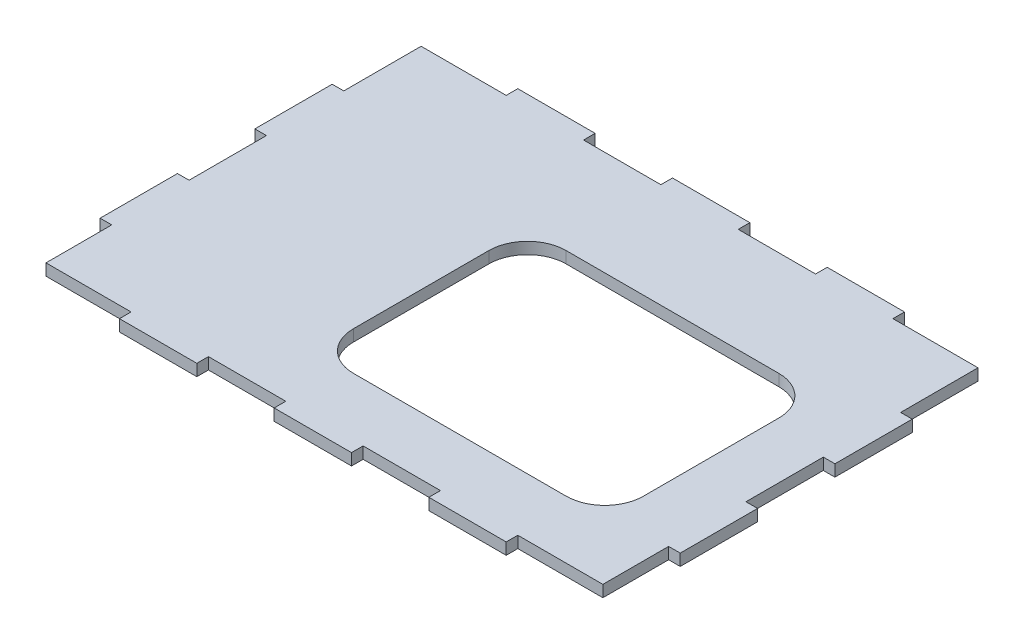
ISO-10303-21;
HEADER;
FILE_DESCRIPTION(('STEP AP214'),'2;1');
FILE_NAME('part.step','',(''),(''),'','','');
FILE_SCHEMA(('AUTOMOTIVE_DESIGN { 1 0 10303 214 1 1 1 1 }'));
ENDSEC;
DATA;
#1=APPLICATION_CONTEXT('core data for automotive mechanical design processes');
#2=APPLICATION_PROTOCOL_DEFINITION('international standard','automotive_design',2000,#1);
#3=PRODUCT_CONTEXT('',#1,'mechanical');
#4=PRODUCT('Part','Part','',(#3));
#5=PRODUCT_RELATED_PRODUCT_CATEGORY('part','',(#4));
#6=PRODUCT_DEFINITION_FORMATION('','',#4);
#7=PRODUCT_DEFINITION_CONTEXT('part definition',#1,'design');
#8=PRODUCT_DEFINITION('design','',#6,#7);
#9=PRODUCT_DEFINITION_SHAPE('','',#8);
#10=(LENGTH_UNIT() NAMED_UNIT(*) SI_UNIT(.MILLI.,.METRE.));
#11=(NAMED_UNIT(*) PLANE_ANGLE_UNIT() SI_UNIT($,.RADIAN.));
#12=(NAMED_UNIT(*) SI_UNIT($,.STERADIAN.) SOLID_ANGLE_UNIT());
#13=UNCERTAINTY_MEASURE_WITH_UNIT(LENGTH_MEASURE(1.E-05),#10,'distance_accuracy_value','');
#14=(GEOMETRIC_REPRESENTATION_CONTEXT(3) GLOBAL_UNCERTAINTY_ASSIGNED_CONTEXT((#13)) GLOBAL_UNIT_ASSIGNED_CONTEXT((#10,
#11,#12)) REPRESENTATION_CONTEXT('',''));
#15=CARTESIAN_POINT('',(0.,0.,0.));
#16=DIRECTION('',(0.,0.,1.));
#17=DIRECTION('',(1.,0.,0.));
#18=AXIS2_PLACEMENT_3D('',#15,#16,#17);
#19=CARTESIAN_POINT('',(0.,0.,-400.));
#20=DIRECTION('',(0.,0.,-1.));
#21=DIRECTION('',(-1.,0.,0.));
#22=AXIS2_PLACEMENT_3D('',#19,#20,#21);
#23=PLANE('',#22);
#24=DIRECTION('',(-1.,0.,0.));
#25=VECTOR('',#24,1.);
#26=CARTESIAN_POINT('',(0.,0.,-400.));
#27=LINE('',#26,#25);
#28=CARTESIAN_POINT('',(260.,0.,-400.));
#29=VERTEX_POINT('',#28);
#30=CARTESIAN_POINT('',(180.,0.,-400.));
#31=VERTEX_POINT('',#30);
#32=EDGE_CURVE('E392',#29,#31,#27,.T.);
#33=ORIENTED_EDGE('',*,*,#32,.F.);
#34=DIRECTION('',(0.,1.,0.));
#35=VECTOR('',#34,1.);
#36=CARTESIAN_POINT('',(260.,0.,-400.));
#37=LINE('',#36,#35);
#38=CARTESIAN_POINT('',(260.,12.,-400.));
#39=VERTEX_POINT('',#38);
#40=EDGE_CURVE('E378',#29,#39,#37,.T.);
#41=ORIENTED_EDGE('',*,*,#40,.T.);
#42=DIRECTION('',(-1.,0.,0.));
#43=VECTOR('',#42,1.);
#44=CARTESIAN_POINT('',(0.,12.,-400.));
#45=LINE('',#44,#43);
#46=CARTESIAN_POINT('',(180.,12.,-400.));
#47=VERTEX_POINT('',#46);
#48=EDGE_CURVE('E390',#39,#47,#45,.T.);
#49=ORIENTED_EDGE('',*,*,#48,.T.);
#50=DIRECTION('',(0.,1.,0.));
#51=VECTOR('',#50,1.);
#52=CARTESIAN_POINT('',(180.,0.,-400.));
#53=LINE('',#52,#51);
#54=EDGE_CURVE('E485',#31,#47,#53,.T.);
#55=ORIENTED_EDGE('',*,*,#54,.F.);
#56=EDGE_LOOP('',(#33,#41,#49,#55));
#57=FACE_BOUND('',#56,.T.);
#58=ADVANCED_FACE('F45',(#57),#23,.F.);
#59=CARTESIAN_POINT('',(420.,12.,-400.));
#60=VERTEX_POINT('',#59);
#61=CARTESIAN_POINT('',(340.,12.,-400.));
#62=VERTEX_POINT('',#61);
#63=EDGE_CURVE('E401',#60,#62,#45,.T.);
#64=ORIENTED_EDGE('',*,*,#63,.T.);
#65=DIRECTION('',(0.,1.,0.));
#66=VECTOR('',#65,1.);
#67=CARTESIAN_POINT('',(340.,0.,-400.));
#68=LINE('',#67,#66);
#69=CARTESIAN_POINT('',(340.,0.,-400.));
#70=VERTEX_POINT('',#69);
#71=EDGE_CURVE('E393',#70,#62,#68,.T.);
#72=ORIENTED_EDGE('',*,*,#71,.F.);
#73=CARTESIAN_POINT('',(420.,0.,-400.));
#74=VERTEX_POINT('',#73);
#75=EDGE_CURVE('E415',#74,#70,#27,.T.);
#76=ORIENTED_EDGE('',*,*,#75,.F.);
#77=DIRECTION('',(0.,1.,0.));
#78=VECTOR('',#77,1.);
#79=CARTESIAN_POINT('',(420.,0.,-400.));
#80=LINE('',#79,#78);
#81=EDGE_CURVE('E385',#74,#60,#80,.T.);
#82=ORIENTED_EDGE('',*,*,#81,.T.);
#83=EDGE_LOOP('',(#64,#72,#76,#82));
#84=FACE_BOUND('',#83,.T.);
#85=ADVANCED_FACE('F430',(#84),#23,.F.);
#86=CARTESIAN_POINT('',(588.,12.,-400.));
#87=VERTEX_POINT('',#86);
#88=CARTESIAN_POINT('',(500.,12.,-400.));
#89=VERTEX_POINT('',#88);
#90=EDGE_CURVE('E404',#87,#89,#45,.T.);
#91=ORIENTED_EDGE('',*,*,#90,.T.);
#92=DIRECTION('',(0.,1.,0.));
#93=VECTOR('',#92,1.);
#94=CARTESIAN_POINT('',(500.,0.,-400.));
#95=LINE('',#94,#93);
#96=CARTESIAN_POINT('',(500.,0.,-400.));
#97=VERTEX_POINT('',#96);
#98=EDGE_CURVE('E452',#97,#89,#95,.T.);
#99=ORIENTED_EDGE('',*,*,#98,.F.);
#100=CARTESIAN_POINT('',(588.,0.,-400.));
#101=VERTEX_POINT('',#100);
#102=EDGE_CURVE('E414',#101,#97,#27,.T.);
#103=ORIENTED_EDGE('',*,*,#102,.F.);
#104=DIRECTION('',(0.,-1.,0.));
#105=VECTOR('',#104,1.);
#106=CARTESIAN_POINT('',(588.,0.,-400.));
#107=LINE('',#106,#105);
#108=EDGE_CURVE('E421',#87,#101,#107,.T.);
#109=ORIENTED_EDGE('',*,*,#108,.F.);
#110=EDGE_LOOP('',(#91,#99,#103,#109));
#111=FACE_BOUND('',#110,.T.);
#112=ADVANCED_FACE('F602',(#111),#23,.F.);
#113=CARTESIAN_POINT('',(0.,12.,0.));
#114=DIRECTION('',(1.,0.,0.));
#115=DIRECTION('',(0.,0.,-1.));
#116=AXIS2_PLACEMENT_3D('',#113,#114,#115);
#117=PLANE('',#116);
#118=DIRECTION('',(0.,0.,1.));
#119=VECTOR('',#118,1.);
#120=CARTESIAN_POINT('',(0.,12.,0.));
#121=LINE('',#120,#119);
#122=CARTESIAN_POINT('',(0.,12.,-708.));
#123=VERTEX_POINT('',#122);
#124=CARTESIAN_POINT('',(0.,12.,-628.));
#125=VERTEX_POINT('',#124);
#126=EDGE_CURVE('E630',#123,#125,#121,.T.);
#127=ORIENTED_EDGE('',*,*,#126,.F.);
#128=DIRECTION('',(0.,1.,0.));
#129=VECTOR('',#128,1.);
#130=CARTESIAN_POINT('',(0.,0.,-708.));
#131=LINE('',#130,#129);
#132=CARTESIAN_POINT('',(0.,0.,-708.));
#133=VERTEX_POINT('',#132);
#134=EDGE_CURVE('E632',#133,#123,#131,.T.);
#135=ORIENTED_EDGE('',*,*,#134,.F.);
#136=DIRECTION('',(0.,0.,1.));
#137=VECTOR('',#136,1.);
#138=CARTESIAN_POINT('',(0.,0.,0.));
#139=LINE('',#138,#137);
#140=CARTESIAN_POINT('',(0.,0.,-628.));
#141=VERTEX_POINT('',#140);
#142=EDGE_CURVE('E656',#133,#141,#139,.T.);
#143=ORIENTED_EDGE('',*,*,#142,.T.);
#144=DIRECTION('',(0.,1.,0.));
#145=VECTOR('',#144,1.);
#146=CARTESIAN_POINT('',(0.,0.,-628.));
#147=LINE('',#146,#145);
#148=EDGE_CURVE('E634',#141,#125,#147,.T.);
#149=ORIENTED_EDGE('',*,*,#148,.T.);
#150=EDGE_LOOP('',(#127,#135,#143,#149));
#151=FACE_BOUND('',#150,.T.);
#152=ADVANCED_FACE('F47',(#151),#117,.F.);
#153=CARTESIAN_POINT('',(0.,12.,-548.));
#154=VERTEX_POINT('',#153);
#155=CARTESIAN_POINT('',(0.,12.,-468.));
#156=VERTEX_POINT('',#155);
#157=EDGE_CURVE('E638',#154,#156,#121,.T.);
#158=ORIENTED_EDGE('',*,*,#157,.F.);
#159=DIRECTION('',(0.,1.,0.));
#160=VECTOR('',#159,1.);
#161=CARTESIAN_POINT('',(0.,0.,-548.));
#162=LINE('',#161,#160);
#163=CARTESIAN_POINT('',(0.,0.,-548.));
#164=VERTEX_POINT('',#163);
#165=EDGE_CURVE('E1024',#164,#154,#162,.T.);
#166=ORIENTED_EDGE('',*,*,#165,.F.);
#167=CARTESIAN_POINT('',(0.,0.,-468.));
#168=VERTEX_POINT('',#167);
#169=EDGE_CURVE('E653',#164,#168,#139,.T.);
#170=ORIENTED_EDGE('',*,*,#169,.T.);
#171=DIRECTION('',(0.,1.,0.));
#172=VECTOR('',#171,1.);
#173=CARTESIAN_POINT('',(0.,0.,-468.));
#174=LINE('',#173,#172);
#175=EDGE_CURVE('E785',#168,#156,#174,.T.);
#176=ORIENTED_EDGE('',*,*,#175,.T.);
#177=EDGE_LOOP('',(#158,#166,#170,#176));
#178=FACE_BOUND('',#177,.T.);
#179=ADVANCED_FACE('F619',(#178),#117,.F.);
#180=CARTESIAN_POINT('',(600.,12.,0.));
#181=DIRECTION('',(-1.,0.,0.));
#182=DIRECTION('',(0.,0.,1.));
#183=AXIS2_PLACEMENT_3D('',#180,#181,#182);
#184=PLANE('',#183);
#185=DIRECTION('',(0.,0.,-1.));
#186=VECTOR('',#185,1.);
#187=CARTESIAN_POINT('',(600.,12.,0.));
#188=LINE('',#187,#186);
#189=CARTESIAN_POINT('',(600.,12.,-468.));
#190=VERTEX_POINT('',#189);
#191=CARTESIAN_POINT('',(600.,12.,-548.));
#192=VERTEX_POINT('',#191);
#193=EDGE_CURVE('E641',#190,#192,#188,.T.);
#194=ORIENTED_EDGE('',*,*,#193,.F.);
#195=DIRECTION('',(0.,1.,0.));
#196=VECTOR('',#195,1.);
#197=CARTESIAN_POINT('',(600.,0.,-468.));
#198=LINE('',#197,#196);
#199=CARTESIAN_POINT('',(600.,0.,-468.));
#200=VERTEX_POINT('',#199);
#201=EDGE_CURVE('E798',#200,#190,#198,.T.);
#202=ORIENTED_EDGE('',*,*,#201,.F.);
#203=DIRECTION('',(0.,0.,-1.));
#204=VECTOR('',#203,1.);
#205=CARTESIAN_POINT('',(600.,0.,0.));
#206=LINE('',#205,#204);
#207=CARTESIAN_POINT('',(600.,0.,-548.));
#208=VERTEX_POINT('',#207);
#209=EDGE_CURVE('E660',#200,#208,#206,.T.);
#210=ORIENTED_EDGE('',*,*,#209,.T.);
#211=DIRECTION('',(0.,1.,0.));
#212=VECTOR('',#211,1.);
#213=CARTESIAN_POINT('',(600.,0.,-548.));
#214=LINE('',#213,#212);
#215=EDGE_CURVE('E765',#208,#192,#214,.T.);
#216=ORIENTED_EDGE('',*,*,#215,.T.);
#217=EDGE_LOOP('',(#194,#202,#210,#216));
#218=FACE_BOUND('',#217,.T.);
#219=ADVANCED_FACE('F624',(#218),#184,.F.);
#220=CARTESIAN_POINT('',(0.,12.,-800.));
#221=DIRECTION('',(0.,0.,1.));
#222=DIRECTION('',(1.,0.,0.));
#223=AXIS2_PLACEMENT_3D('',#220,#221,#222);
#224=PLANE('',#223);
#225=DIRECTION('',(-1.,0.,0.));
#226=VECTOR('',#225,1.);
#227=CARTESIAN_POINT('',(0.,0.,-800.));
#228=LINE('',#227,#226);
#229=CARTESIAN_POINT('',(340.,0.,-800.));
#230=VERTEX_POINT('',#229);
#231=CARTESIAN_POINT('',(260.,0.,-800.));
#232=VERTEX_POINT('',#231);
#233=EDGE_CURVE('E663',#230,#232,#228,.T.);
#234=ORIENTED_EDGE('',*,*,#233,.T.);
#235=DIRECTION('',(0.,1.,0.));
#236=VECTOR('',#235,1.);
#237=CARTESIAN_POINT('',(260.,0.,-800.));
#238=LINE('',#237,#236);
#239=CARTESIAN_POINT('',(260.,12.,-800.));
#240=VERTEX_POINT('',#239);
#241=EDGE_CURVE('E819',#232,#240,#238,.T.);
#242=ORIENTED_EDGE('',*,*,#241,.T.);
#243=DIRECTION('',(-1.,0.,0.));
#244=VECTOR('',#243,1.);
#245=CARTESIAN_POINT('',(0.,12.,-800.));
#246=LINE('',#245,#244);
#247=CARTESIAN_POINT('',(340.,12.,-800.));
#248=VERTEX_POINT('',#247);
#249=EDGE_CURVE('E652',#248,#240,#246,.T.);
#250=ORIENTED_EDGE('',*,*,#249,.F.);
#251=DIRECTION('',(0.,1.,0.));
#252=VECTOR('',#251,1.);
#253=CARTESIAN_POINT('',(340.,0.,-800.));
#254=LINE('',#253,#252);
#255=EDGE_CURVE('E689',#230,#248,#254,.T.);
#256=ORIENTED_EDGE('',*,*,#255,.F.);
#257=EDGE_LOOP('',(#234,#242,#250,#256));
#258=FACE_BOUND('',#257,.T.);
#259=ADVANCED_FACE('F915',(#258),#224,.F.);
#260=CARTESIAN_POINT('',(500.,12.,-800.));
#261=VERTEX_POINT('',#260);
#262=CARTESIAN_POINT('',(420.,12.,-800.));
#263=VERTEX_POINT('',#262);
#264=EDGE_CURVE('E53',#261,#263,#246,.T.);
#265=ORIENTED_EDGE('',*,*,#264,.F.);
#266=DIRECTION('',(0.,1.,0.));
#267=VECTOR('',#266,1.);
#268=CARTESIAN_POINT('',(500.,0.,-800.));
#269=LINE('',#268,#267);
#270=CARTESIAN_POINT('',(500.,0.,-800.));
#271=VERTEX_POINT('',#270);
#272=EDGE_CURVE('E679',#271,#261,#269,.T.);
#273=ORIENTED_EDGE('',*,*,#272,.F.);
#274=CARTESIAN_POINT('',(420.,0.,-800.));
#275=VERTEX_POINT('',#274);
#276=EDGE_CURVE('E644',#271,#275,#228,.T.);
#277=ORIENTED_EDGE('',*,*,#276,.T.);
#278=DIRECTION('',(0.,1.,0.));
#279=VECTOR('',#278,1.);
#280=CARTESIAN_POINT('',(420.,0.,-800.));
#281=LINE('',#280,#279);
#282=EDGE_CURVE('E677',#275,#263,#281,.T.);
#283=ORIENTED_EDGE('',*,*,#282,.T.);
#284=EDGE_LOOP('',(#265,#273,#277,#283));
#285=FACE_BOUND('',#284,.T.);
#286=ADVANCED_FACE('F676',(#285),#224,.F.);
#287=CARTESIAN_POINT('',(600.,0.,-628.));
#288=VERTEX_POINT('',#287);
#289=CARTESIAN_POINT('',(600.,0.,-708.));
#290=VERTEX_POINT('',#289);
#291=EDGE_CURVE('E658',#288,#290,#206,.T.);
#292=ORIENTED_EDGE('',*,*,#291,.T.);
#293=DIRECTION('',(0.,1.,0.));
#294=VECTOR('',#293,1.);
#295=CARTESIAN_POINT('',(600.,0.,-708.));
#296=LINE('',#295,#294);
#297=CARTESIAN_POINT('',(600.,12.,-708.));
#298=VERTEX_POINT('',#297);
#299=EDGE_CURVE('E709',#290,#298,#296,.T.);
#300=ORIENTED_EDGE('',*,*,#299,.T.);
#301=CARTESIAN_POINT('',(600.,12.,-628.));
#302=VERTEX_POINT('',#301);
#303=EDGE_CURVE('E637',#302,#298,#188,.T.);
#304=ORIENTED_EDGE('',*,*,#303,.F.);
#305=DIRECTION('',(0.,1.,0.));
#306=VECTOR('',#305,1.);
#307=CARTESIAN_POINT('',(600.,0.,-628.));
#308=LINE('',#307,#306);
#309=EDGE_CURVE('E748',#288,#302,#308,.T.);
#310=ORIENTED_EDGE('',*,*,#309,.F.);
#311=EDGE_LOOP('',(#292,#300,#304,#310));
#312=FACE_BOUND('',#311,.T.);
#313=ADVANCED_FACE('F746',(#312),#184,.F.);
#314=CARTESIAN_POINT('',(180.,0.,-800.));
#315=VERTEX_POINT('',#314);
#316=CARTESIAN_POINT('',(100.,0.,-800.));
#317=VERTEX_POINT('',#316);
#318=EDGE_CURVE('E661',#315,#317,#228,.T.);
#319=ORIENTED_EDGE('',*,*,#318,.T.);
#320=DIRECTION('',(0.,1.,0.));
#321=VECTOR('',#320,1.);
#322=CARTESIAN_POINT('',(100.,0.,-800.));
#323=LINE('',#322,#321);
#324=CARTESIAN_POINT('',(100.,12.,-800.));
#325=VERTEX_POINT('',#324);
#326=EDGE_CURVE('E794',#317,#325,#323,.T.);
#327=ORIENTED_EDGE('',*,*,#326,.T.);
#328=CARTESIAN_POINT('',(180.,12.,-800.));
#329=VERTEX_POINT('',#328);
#330=EDGE_CURVE('E649',#329,#325,#246,.T.);
#331=ORIENTED_EDGE('',*,*,#330,.F.);
#332=DIRECTION('',(0.,1.,0.));
#333=VECTOR('',#332,1.);
#334=CARTESIAN_POINT('',(180.,0.,-800.));
#335=LINE('',#334,#333);
#336=EDGE_CURVE('E812',#315,#329,#335,.T.);
#337=ORIENTED_EDGE('',*,*,#336,.F.);
#338=EDGE_LOOP('',(#319,#327,#331,#337));
#339=FACE_BOUND('',#338,.T.);
#340=ADVANCED_FACE('F910',(#339),#224,.F.);
#341=CARTESIAN_POINT('',(0.,12.,0.));
#342=DIRECTION('',(0.,-1.,0.));
#343=DIRECTION('',(0.,0.,-1.));
#344=AXIS2_PLACEMENT_3D('',#341,#342,#343);
#345=PLANE('',#344);
#346=DIRECTION('',(-1.,0.,0.));
#347=VECTOR('',#346,1.);
#348=CARTESIAN_POINT('',(270.,12.,-680.));
#349=LINE('',#348,#347);
#350=CARTESIAN_POINT('',(490.,12.,-680.));
#351=VERTEX_POINT('',#350);
#352=CARTESIAN_POINT('',(270.,12.,-680.));
#353=VERTEX_POINT('',#352);
#354=EDGE_CURVE('E521',#351,#353,#349,.T.);
#355=ORIENTED_EDGE('',*,*,#354,.F.);
#356=CARTESIAN_POINT('',(490.,12.,-640.));
#357=DIRECTION('',(0.,1.,0.));
#358=DIRECTION('',(0.,0.,-1.));
#359=AXIS2_PLACEMENT_3D('',#356,#357,#358);
#360=CIRCLE('',#359,40.);
#361=CARTESIAN_POINT('',(530.,12.,-640.));
#362=VERTEX_POINT('',#361);
#363=EDGE_CURVE('E487',#362,#351,#360,.T.);
#364=ORIENTED_EDGE('',*,*,#363,.F.);
#365=DIRECTION('',(0.,0.,-1.));
#366=VECTOR('',#365,1.);
#367=CARTESIAN_POINT('',(530.,12.,-640.));
#368=LINE('',#367,#366);
#369=CARTESIAN_POINT('',(530.,12.,-500.));
#370=VERTEX_POINT('',#369);
#371=EDGE_CURVE('E498',#370,#362,#368,.T.);
#372=ORIENTED_EDGE('',*,*,#371,.F.);
#373=CARTESIAN_POINT('',(490.,12.,-500.));
#374=DIRECTION('',(0.,1.,0.));
#375=DIRECTION('',(0.,0.,1.));
#376=AXIS2_PLACEMENT_3D('',#373,#374,#375);
#377=CIRCLE('',#376,39.9999999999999);
#378=CARTESIAN_POINT('',(490.,12.,-460.));
#379=VERTEX_POINT('',#378);
#380=EDGE_CURVE('E536',#379,#370,#377,.T.);
#381=ORIENTED_EDGE('',*,*,#380,.F.);
#382=DIRECTION('',(1.,0.,0.));
#383=VECTOR('',#382,1.);
#384=CARTESIAN_POINT('',(270.,12.,-460.));
#385=LINE('',#384,#383);
#386=CARTESIAN_POINT('',(270.,12.,-460.));
#387=VERTEX_POINT('',#386);
#388=EDGE_CURVE('E533',#387,#379,#385,.T.);
#389=ORIENTED_EDGE('',*,*,#388,.F.);
#390=CARTESIAN_POINT('',(270.,12.,-500.));
#391=DIRECTION('',(0.,1.,0.));
#392=DIRECTION('',(0.,0.,1.));
#393=AXIS2_PLACEMENT_3D('',#390,#391,#392);
#394=CIRCLE('',#393,40.);
#395=CARTESIAN_POINT('',(230.,12.,-500.));
#396=VERTEX_POINT('',#395);
#397=EDGE_CURVE('E530',#396,#387,#394,.T.);
#398=ORIENTED_EDGE('',*,*,#397,.F.);
#399=DIRECTION('',(0.,0.,1.));
#400=VECTOR('',#399,1.);
#401=CARTESIAN_POINT('',(230.,12.,-640.));
#402=LINE('',#401,#400);
#403=CARTESIAN_POINT('',(230.,12.,-640.));
#404=VERTEX_POINT('',#403);
#405=EDGE_CURVE('E527',#404,#396,#402,.T.);
#406=ORIENTED_EDGE('',*,*,#405,.F.);
#407=CARTESIAN_POINT('',(270.,12.,-640.));
#408=DIRECTION('',(0.,1.,0.));
#409=DIRECTION('',(0.,0.,1.));
#410=AXIS2_PLACEMENT_3D('',#407,#408,#409);
#411=CIRCLE('',#410,40.);
#412=EDGE_CURVE('E524',#353,#404,#411,.T.);
#413=ORIENTED_EDGE('',*,*,#412,.F.);
#414=EDGE_LOOP('',(#355,#364,#372,#381,#389,#398,#406,#413));
#415=FACE_BOUND('',#414,.T.);
#416=DIRECTION('',(0.,0.,-1.));
#417=VECTOR('',#416,1.);
#418=CARTESIAN_POINT('',(12.0000000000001,12.,-332.));
#419=LINE('',#418,#417);
#420=CARTESIAN_POINT('',(12.0000000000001,12.,-400.));
#421=VERTEX_POINT('',#420);
#422=CARTESIAN_POINT('',(12.0000000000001,12.,-468.));
#423=VERTEX_POINT('',#422);
#424=EDGE_CURVE('E791',#421,#423,#419,.T.);
#425=ORIENTED_EDGE('',*,*,#424,.F.);
#426=CARTESIAN_POINT('',(100.,12.,-400.));
#427=VERTEX_POINT('',#426);
#428=EDGE_CURVE('E402',#427,#421,#45,.T.);
#429=ORIENTED_EDGE('',*,*,#428,.F.);
#430=DIRECTION('',(0.,0.,1.));
#431=VECTOR('',#430,1.);
#432=CARTESIAN_POINT('',(100.,12.,-400.));
#433=LINE('',#432,#431);
#434=CARTESIAN_POINT('',(100.,12.,-388.));
#435=VERTEX_POINT('',#434);
#436=EDGE_CURVE('E464',#427,#435,#433,.T.);
#437=ORIENTED_EDGE('',*,*,#436,.T.);
#438=DIRECTION('',(1.,0.,0.));
#439=VECTOR('',#438,1.);
#440=CARTESIAN_POINT('',(100.,12.,-388.));
#441=LINE('',#440,#439);
#442=CARTESIAN_POINT('',(180.,12.,-388.));
#443=VERTEX_POINT('',#442);
#444=EDGE_CURVE('E482',#435,#443,#441,.T.);
#445=ORIENTED_EDGE('',*,*,#444,.T.);
#446=DIRECTION('',(0.,0.,-1.));
#447=VECTOR('',#446,1.);
#448=CARTESIAN_POINT('',(180.,12.,-388.));
#449=LINE('',#448,#447);
#450=EDGE_CURVE('E400',#443,#47,#449,.T.);
#451=ORIENTED_EDGE('',*,*,#450,.T.);
#452=ORIENTED_EDGE('',*,*,#48,.F.);
#453=DIRECTION('',(0.,0.,1.));
#454=VECTOR('',#453,1.);
#455=CARTESIAN_POINT('',(260.,12.,-400.));
#456=LINE('',#455,#454);
#457=CARTESIAN_POINT('',(260.,12.,-388.));
#458=VERTEX_POINT('',#457);
#459=EDGE_CURVE('E375',#39,#458,#456,.T.);
#460=ORIENTED_EDGE('',*,*,#459,.T.);
#461=DIRECTION('',(1.,0.,0.));
#462=VECTOR('',#461,1.);
#463=CARTESIAN_POINT('',(260.,12.,-388.));
#464=LINE('',#463,#462);
#465=CARTESIAN_POINT('',(340.,12.,-388.));
#466=VERTEX_POINT('',#465);
#467=EDGE_CURVE('E386',#458,#466,#464,.T.);
#468=ORIENTED_EDGE('',*,*,#467,.T.);
#469=DIRECTION('',(0.,0.,-1.));
#470=VECTOR('',#469,1.);
#471=CARTESIAN_POINT('',(340.,12.,-400.));
#472=LINE('',#471,#470);
#473=EDGE_CURVE('E440',#466,#62,#472,.T.);
#474=ORIENTED_EDGE('',*,*,#473,.T.);
#475=ORIENTED_EDGE('',*,*,#63,.F.);
#476=DIRECTION('',(0.,0.,1.));
#477=VECTOR('',#476,1.);
#478=CARTESIAN_POINT('',(420.,12.,-400.));
#479=LINE('',#478,#477);
#480=CARTESIAN_POINT('',(420.,12.,-388.));
#481=VERTEX_POINT('',#480);
#482=EDGE_CURVE('E461',#60,#481,#479,.T.);
#483=ORIENTED_EDGE('',*,*,#482,.T.);
#484=DIRECTION('',(1.,0.,0.));
#485=VECTOR('',#484,1.);
#486=CARTESIAN_POINT('',(420.,12.,-388.));
#487=LINE('',#486,#485);
#488=CARTESIAN_POINT('',(500.,12.,-388.));
#489=VERTEX_POINT('',#488);
#490=EDGE_CURVE('E458',#481,#489,#487,.T.);
#491=ORIENTED_EDGE('',*,*,#490,.T.);
#492=DIRECTION('',(0.,0.,-1.));
#493=VECTOR('',#492,1.);
#494=CARTESIAN_POINT('',(500.,12.,-400.));
#495=LINE('',#494,#493);
#496=EDGE_CURVE('E455',#489,#89,#495,.T.);
#497=ORIENTED_EDGE('',*,*,#496,.T.);
#498=ORIENTED_EDGE('',*,*,#90,.F.);
#499=DIRECTION('',(0.,0.,1.));
#500=VECTOR('',#499,1.);
#501=CARTESIAN_POINT('',(588.,12.,-332.));
#502=LINE('',#501,#500);
#503=CARTESIAN_POINT('',(588.,12.,-468.));
#504=VERTEX_POINT('',#503);
#505=EDGE_CURVE('E802',#504,#87,#502,.T.);
#506=ORIENTED_EDGE('',*,*,#505,.F.);
#507=DIRECTION('',(-1.,0.,0.));
#508=VECTOR('',#507,1.);
#509=CARTESIAN_POINT('',(600.,12.,-468.));
#510=LINE('',#509,#508);
#511=EDGE_CURVE('E788',#190,#504,#510,.T.);
#512=ORIENTED_EDGE('',*,*,#511,.F.);
#513=ORIENTED_EDGE('',*,*,#193,.T.);
#514=DIRECTION('',(1.,0.,0.));
#515=VECTOR('',#514,1.);
#516=CARTESIAN_POINT('',(600.,12.,-548.));
#517=LINE('',#516,#515);
#518=CARTESIAN_POINT('',(588.,12.,-548.));
#519=VERTEX_POINT('',#518);
#520=EDGE_CURVE('E769',#519,#192,#517,.T.);
#521=ORIENTED_EDGE('',*,*,#520,.F.);
#522=DIRECTION('',(0.,0.,1.));
#523=VECTOR('',#522,1.);
#524=CARTESIAN_POINT('',(588.,12.,-628.));
#525=LINE('',#524,#523);
#526=CARTESIAN_POINT('',(588.,12.,-628.));
#527=VERTEX_POINT('',#526);
#528=EDGE_CURVE('E771',#527,#519,#525,.T.);
#529=ORIENTED_EDGE('',*,*,#528,.F.);
#530=DIRECTION('',(-1.,0.,0.));
#531=VECTOR('',#530,1.);
#532=CARTESIAN_POINT('',(600.,12.,-628.));
#533=LINE('',#532,#531);
#534=EDGE_CURVE('E775',#302,#527,#533,.T.);
#535=ORIENTED_EDGE('',*,*,#534,.F.);
#536=ORIENTED_EDGE('',*,*,#303,.T.);
#537=DIRECTION('',(1.,0.,0.));
#538=VECTOR('',#537,1.);
#539=CARTESIAN_POINT('',(600.,12.,-708.));
#540=LINE('',#539,#538);
#541=CARTESIAN_POINT('',(588.,12.,-708.));
#542=VERTEX_POINT('',#541);
#543=EDGE_CURVE('E712',#542,#298,#540,.T.);
#544=ORIENTED_EDGE('',*,*,#543,.F.);
#545=DIRECTION('',(0.,0.,1.));
#546=VECTOR('',#545,1.);
#547=CARTESIAN_POINT('',(588.,12.,-708.));
#548=LINE('',#547,#546);
#549=CARTESIAN_POINT('',(588.,12.,-788.));
#550=VERTEX_POINT('',#549);
#551=EDGE_CURVE('E714',#550,#542,#548,.T.);
#552=ORIENTED_EDGE('',*,*,#551,.F.);
#553=DIRECTION('',(1.,0.,0.));
#554=VECTOR('',#553,1.);
#555=CARTESIAN_POINT('',(500.,12.,-788.));
#556=LINE('',#555,#554);
#557=CARTESIAN_POINT('',(500.,12.,-788.));
#558=VERTEX_POINT('',#557);
#559=EDGE_CURVE('E717',#558,#550,#556,.T.);
#560=ORIENTED_EDGE('',*,*,#559,.F.);
#561=DIRECTION('',(0.,0.,1.));
#562=VECTOR('',#561,1.);
#563=CARTESIAN_POINT('',(500.,12.,-800.));
#564=LINE('',#563,#562);
#565=EDGE_CURVE('E657',#261,#558,#564,.T.);
#566=ORIENTED_EDGE('',*,*,#565,.F.);
#567=ORIENTED_EDGE('',*,*,#264,.T.);
#568=DIRECTION('',(0.,0.,-1.));
#569=VECTOR('',#568,1.);
#570=CARTESIAN_POINT('',(420.,12.,-800.));
#571=LINE('',#570,#569);
#572=CARTESIAN_POINT('',(420.,12.,-788.));
#573=VERTEX_POINT('',#572);
#574=EDGE_CURVE('E700',#573,#263,#571,.T.);
#575=ORIENTED_EDGE('',*,*,#574,.F.);
#576=DIRECTION('',(1.,0.,0.));
#577=VECTOR('',#576,1.);
#578=CARTESIAN_POINT('',(340.,12.,-788.));
#579=LINE('',#578,#577);
#580=CARTESIAN_POINT('',(340.,12.,-788.));
#581=VERTEX_POINT('',#580);
#582=EDGE_CURVE('E873',#581,#573,#579,.T.);
#583=ORIENTED_EDGE('',*,*,#582,.F.);
#584=DIRECTION('',(0.,0.,1.));
#585=VECTOR('',#584,1.);
#586=CARTESIAN_POINT('',(340.,12.,-800.));
#587=LINE('',#586,#585);
#588=EDGE_CURVE('E696',#248,#581,#587,.T.);
#589=ORIENTED_EDGE('',*,*,#588,.F.);
#590=ORIENTED_EDGE('',*,*,#249,.T.);
#591=DIRECTION('',(0.,0.,-1.));
#592=VECTOR('',#591,1.);
#593=CARTESIAN_POINT('',(260.,12.,-800.));
#594=LINE('',#593,#592);
#595=CARTESIAN_POINT('',(260.,12.,-788.));
#596=VERTEX_POINT('',#595);
#597=EDGE_CURVE('E823',#596,#240,#594,.T.);
#598=ORIENTED_EDGE('',*,*,#597,.F.);
#599=DIRECTION('',(1.,0.,0.));
#600=VECTOR('',#599,1.);
#601=CARTESIAN_POINT('',(180.,12.,-788.));
#602=LINE('',#601,#600);
#603=CARTESIAN_POINT('',(180.,12.,-788.));
#604=VERTEX_POINT('',#603);
#605=EDGE_CURVE('E825',#604,#596,#602,.T.);
#606=ORIENTED_EDGE('',*,*,#605,.F.);
#607=DIRECTION('',(0.,0.,1.));
#608=VECTOR('',#607,1.);
#609=CARTESIAN_POINT('',(180.,12.,-800.));
#610=LINE('',#609,#608);
#611=EDGE_CURVE('E829',#329,#604,#610,.T.);
#612=ORIENTED_EDGE('',*,*,#611,.F.);
#613=ORIENTED_EDGE('',*,*,#330,.T.);
#614=DIRECTION('',(0.,0.,-1.));
#615=VECTOR('',#614,1.);
#616=CARTESIAN_POINT('',(100.,12.,-800.));
#617=LINE('',#616,#615);
#618=CARTESIAN_POINT('',(100.,12.,-788.));
#619=VERTEX_POINT('',#618);
#620=EDGE_CURVE('E848',#619,#325,#617,.T.);
#621=ORIENTED_EDGE('',*,*,#620,.F.);
#622=DIRECTION('',(1.,0.,0.));
#623=VECTOR('',#622,1.);
#624=CARTESIAN_POINT('',(11.9999999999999,12.,-788.));
#625=LINE('',#624,#623);
#626=CARTESIAN_POINT('',(11.9999999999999,12.,-788.));
#627=VERTEX_POINT('',#626);
#628=EDGE_CURVE('E850',#627,#619,#625,.T.);
#629=ORIENTED_EDGE('',*,*,#628,.F.);
#630=DIRECTION('',(0.,0.,-1.));
#631=VECTOR('',#630,1.);
#632=CARTESIAN_POINT('',(11.9999999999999,12.,-708.));
#633=LINE('',#632,#631);
#634=CARTESIAN_POINT('',(11.9999999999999,12.,-708.));
#635=VERTEX_POINT('',#634);
#636=EDGE_CURVE('E854',#635,#627,#633,.T.);
#637=ORIENTED_EDGE('',*,*,#636,.F.);
#638=DIRECTION('',(1.,0.,0.));
#639=VECTOR('',#638,1.);
#640=CARTESIAN_POINT('',(0.,12.,-708.));
#641=LINE('',#640,#639);
#642=EDGE_CURVE('E822',#123,#635,#641,.T.);
#643=ORIENTED_EDGE('',*,*,#642,.F.);
#644=ORIENTED_EDGE('',*,*,#126,.T.);
#645=DIRECTION('',(-1.,0.,0.));
#646=VECTOR('',#645,1.);
#647=CARTESIAN_POINT('',(0.,12.,-628.));
#648=LINE('',#647,#646);
#649=CARTESIAN_POINT('',(11.9999999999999,12.,-628.));
#650=VERTEX_POINT('',#649);
#651=EDGE_CURVE('E768',#650,#125,#648,.T.);
#652=ORIENTED_EDGE('',*,*,#651,.F.);
#653=DIRECTION('',(0.,0.,-1.));
#654=VECTOR('',#653,1.);
#655=CARTESIAN_POINT('',(11.9999999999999,12.,-628.));
#656=LINE('',#655,#654);
#657=CARTESIAN_POINT('',(12.,12.,-548.));
#658=VERTEX_POINT('',#657);
#659=EDGE_CURVE('E1009',#658,#650,#656,.T.);
#660=ORIENTED_EDGE('',*,*,#659,.F.);
#661=DIRECTION('',(1.,0.,0.));
#662=VECTOR('',#661,1.);
#663=CARTESIAN_POINT('',(0.,12.,-548.));
#664=LINE('',#663,#662);
#665=EDGE_CURVE('E1012',#154,#658,#664,.T.);
#666=ORIENTED_EDGE('',*,*,#665,.F.);
#667=ORIENTED_EDGE('',*,*,#157,.T.);
#668=DIRECTION('',(-1.,0.,0.));
#669=VECTOR('',#668,1.);
#670=CARTESIAN_POINT('',(0.,12.,-468.));
#671=LINE('',#670,#669);
#672=EDGE_CURVE('E789',#423,#156,#671,.T.);
#673=ORIENTED_EDGE('',*,*,#672,.F.);
#674=EDGE_LOOP('',(#425,#429,#437,#445,#451,#452,#460,#468,#474,#475,#483,#491,#497,#498,#506,
#512,#513,#521,#529,#535,#536,#544,#552,#560,#566,#567,#575,#583,#589,#590,#598,#606,#612,#613,
#621,#629,#637,#643,#644,#652,#660,#666,#667,#673));
#675=FACE_BOUND('',#674,.T.);
#676=ADVANCED_FACE('F397',(#415,#675),#345,.F.);
#677=CARTESIAN_POINT('',(0.,0.,0.));
#678=DIRECTION('',(0.,-1.,0.));
#679=DIRECTION('',(0.,0.,-1.));
#680=AXIS2_PLACEMENT_3D('',#677,#678,#679);
#681=PLANE('',#680);
#682=CARTESIAN_POINT('',(490.,0.,-640.));
#683=DIRECTION('',(0.,1.,0.));
#684=DIRECTION('',(0.,0.,-1.));
#685=AXIS2_PLACEMENT_3D('',#682,#683,#684);
#686=CIRCLE('',#685,40.);
#687=CARTESIAN_POINT('',(530.,0.,-640.));
#688=VERTEX_POINT('',#687);
#689=CARTESIAN_POINT('',(490.,0.,-680.));
#690=VERTEX_POINT('',#689);
#691=EDGE_CURVE('E494',#688,#690,#686,.T.);
#692=ORIENTED_EDGE('',*,*,#691,.T.);
#693=DIRECTION('',(-1.,0.,0.));
#694=VECTOR('',#693,1.);
#695=CARTESIAN_POINT('',(270.,0.,-680.));
#696=LINE('',#695,#694);
#697=CARTESIAN_POINT('',(270.,0.,-680.));
#698=VERTEX_POINT('',#697);
#699=EDGE_CURVE('E497',#690,#698,#696,.T.);
#700=ORIENTED_EDGE('',*,*,#699,.T.);
#701=CARTESIAN_POINT('',(270.,0.,-640.));
#702=DIRECTION('',(0.,1.,0.));
#703=DIRECTION('',(0.,0.,1.));
#704=AXIS2_PLACEMENT_3D('',#701,#702,#703);
#705=CIRCLE('',#704,40.);
#706=CARTESIAN_POINT('',(230.,0.,-640.));
#707=VERTEX_POINT('',#706);
#708=EDGE_CURVE('E501',#698,#707,#705,.T.);
#709=ORIENTED_EDGE('',*,*,#708,.T.);
#710=DIRECTION('',(0.,0.,1.));
#711=VECTOR('',#710,1.);
#712=CARTESIAN_POINT('',(230.,0.,-640.));
#713=LINE('',#712,#711);
#714=CARTESIAN_POINT('',(230.,0.,-500.));
#715=VERTEX_POINT('',#714);
#716=EDGE_CURVE('E504',#707,#715,#713,.T.);
#717=ORIENTED_EDGE('',*,*,#716,.T.);
#718=CARTESIAN_POINT('',(270.,0.,-500.));
#719=DIRECTION('',(0.,1.,0.));
#720=DIRECTION('',(0.,0.,1.));
#721=AXIS2_PLACEMENT_3D('',#718,#719,#720);
#722=CIRCLE('',#721,40.);
#723=CARTESIAN_POINT('',(270.,0.,-460.));
#724=VERTEX_POINT('',#723);
#725=EDGE_CURVE('E507',#715,#724,#722,.T.);
#726=ORIENTED_EDGE('',*,*,#725,.T.);
#727=DIRECTION('',(1.,0.,0.));
#728=VECTOR('',#727,1.);
#729=CARTESIAN_POINT('',(270.,0.,-460.));
#730=LINE('',#729,#728);
#731=CARTESIAN_POINT('',(490.,0.,-460.));
#732=VERTEX_POINT('',#731);
#733=EDGE_CURVE('E510',#724,#732,#730,.T.);
#734=ORIENTED_EDGE('',*,*,#733,.T.);
#735=CARTESIAN_POINT('',(490.,0.,-500.));
#736=DIRECTION('',(0.,1.,0.));
#737=DIRECTION('',(0.,0.,1.));
#738=AXIS2_PLACEMENT_3D('',#735,#736,#737);
#739=CIRCLE('',#738,39.9999999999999);
#740=CARTESIAN_POINT('',(530.,0.,-500.));
#741=VERTEX_POINT('',#740);
#742=EDGE_CURVE('E513',#732,#741,#739,.T.);
#743=ORIENTED_EDGE('',*,*,#742,.T.);
#744=DIRECTION('',(0.,0.,-1.));
#745=VECTOR('',#744,1.);
#746=CARTESIAN_POINT('',(530.,0.,-640.));
#747=LINE('',#746,#745);
#748=EDGE_CURVE('E516',#741,#688,#747,.T.);
#749=ORIENTED_EDGE('',*,*,#748,.T.);
#750=EDGE_LOOP('',(#692,#700,#709,#717,#726,#734,#743,#749));
#751=FACE_BOUND('',#750,.T.);
#752=ORIENTED_EDGE('',*,*,#102,.T.);
#753=DIRECTION('',(0.,0.,-1.));
#754=VECTOR('',#753,1.);
#755=CARTESIAN_POINT('',(500.,0.,-400.));
#756=LINE('',#755,#754);
#757=CARTESIAN_POINT('',(500.,0.,-388.));
#758=VERTEX_POINT('',#757);
#759=EDGE_CURVE('E449',#758,#97,#756,.T.);
#760=ORIENTED_EDGE('',*,*,#759,.F.);
#761=DIRECTION('',(1.,0.,0.));
#762=VECTOR('',#761,1.);
#763=CARTESIAN_POINT('',(420.,0.,-388.));
#764=LINE('',#763,#762);
#765=CARTESIAN_POINT('',(420.,0.,-388.));
#766=VERTEX_POINT('',#765);
#767=EDGE_CURVE('E466',#766,#758,#764,.T.);
#768=ORIENTED_EDGE('',*,*,#767,.F.);
#769=DIRECTION('',(0.,0.,1.));
#770=VECTOR('',#769,1.);
#771=CARTESIAN_POINT('',(420.,0.,-400.));
#772=LINE('',#771,#770);
#773=EDGE_CURVE('E67',#74,#766,#772,.T.);
#774=ORIENTED_EDGE('',*,*,#773,.F.);
#775=ORIENTED_EDGE('',*,*,#75,.T.);
#776=DIRECTION('',(0.,0.,-1.));
#777=VECTOR('',#776,1.);
#778=CARTESIAN_POINT('',(340.,0.,-400.));
#779=LINE('',#778,#777);
#780=CARTESIAN_POINT('',(340.,0.,-388.));
#781=VERTEX_POINT('',#780);
#782=EDGE_CURVE('E425',#781,#70,#779,.T.);
#783=ORIENTED_EDGE('',*,*,#782,.F.);
#784=DIRECTION('',(1.,0.,0.));
#785=VECTOR('',#784,1.);
#786=CARTESIAN_POINT('',(260.,0.,-388.));
#787=LINE('',#786,#785);
#788=CARTESIAN_POINT('',(260.,0.,-388.));
#789=VERTEX_POINT('',#788);
#790=EDGE_CURVE('E444',#789,#781,#787,.T.);
#791=ORIENTED_EDGE('',*,*,#790,.F.);
#792=DIRECTION('',(0.,0.,1.));
#793=VECTOR('',#792,1.);
#794=CARTESIAN_POINT('',(260.,0.,-400.));
#795=LINE('',#794,#793);
#796=EDGE_CURVE('E60',#29,#789,#795,.T.);
#797=ORIENTED_EDGE('',*,*,#796,.F.);
#798=ORIENTED_EDGE('',*,*,#32,.T.);
#799=DIRECTION('',(0.,0.,-1.));
#800=VECTOR('',#799,1.);
#801=CARTESIAN_POINT('',(180.,0.,-388.));
#802=LINE('',#801,#800);
#803=CARTESIAN_POINT('',(180.,0.,-388.));
#804=VERTEX_POINT('',#803);
#805=EDGE_CURVE('E476',#804,#31,#802,.T.);
#806=ORIENTED_EDGE('',*,*,#805,.F.);
#807=DIRECTION('',(1.,0.,0.));
#808=VECTOR('',#807,1.);
#809=CARTESIAN_POINT('',(100.,0.,-388.));
#810=LINE('',#809,#808);
#811=CARTESIAN_POINT('',(100.,0.,-388.));
#812=VERTEX_POINT('',#811);
#813=EDGE_CURVE('E473',#812,#804,#810,.T.);
#814=ORIENTED_EDGE('',*,*,#813,.F.);
#815=DIRECTION('',(0.,0.,1.));
#816=VECTOR('',#815,1.);
#817=CARTESIAN_POINT('',(100.,0.,-400.));
#818=LINE('',#817,#816);
#819=CARTESIAN_POINT('',(100.,0.,-400.));
#820=VERTEX_POINT('',#819);
#821=EDGE_CURVE('E470',#820,#812,#818,.T.);
#822=ORIENTED_EDGE('',*,*,#821,.F.);
#823=CARTESIAN_POINT('',(12.0000000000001,0.,-400.));
#824=VERTEX_POINT('',#823);
#825=EDGE_CURVE('E410',#820,#824,#27,.T.);
#826=ORIENTED_EDGE('',*,*,#825,.T.);
#827=DIRECTION('',(0.,0.,-1.));
#828=VECTOR('',#827,1.);
#829=CARTESIAN_POINT('',(12.0000000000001,0.,-332.));
#830=LINE('',#829,#828);
#831=CARTESIAN_POINT('',(12.0000000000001,0.,-468.));
#832=VERTEX_POINT('',#831);
#833=EDGE_CURVE('E792',#824,#832,#830,.T.);
#834=ORIENTED_EDGE('',*,*,#833,.T.);
#835=DIRECTION('',(-1.,0.,0.));
#836=VECTOR('',#835,1.);
#837=CARTESIAN_POINT('',(0.,0.,-468.));
#838=LINE('',#837,#836);
#839=EDGE_CURVE('E784',#832,#168,#838,.T.);
#840=ORIENTED_EDGE('',*,*,#839,.T.);
#841=ORIENTED_EDGE('',*,*,#169,.F.);
#842=DIRECTION('',(1.,0.,0.));
#843=VECTOR('',#842,1.);
#844=CARTESIAN_POINT('',(0.,0.,-548.));
#845=LINE('',#844,#843);
#846=CARTESIAN_POINT('',(12.,0.,-548.));
#847=VERTEX_POINT('',#846);
#848=EDGE_CURVE('E1010',#164,#847,#845,.T.);
#849=ORIENTED_EDGE('',*,*,#848,.T.);
#850=DIRECTION('',(0.,0.,-1.));
#851=VECTOR('',#850,1.);
#852=CARTESIAN_POINT('',(11.9999999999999,0.,-628.));
#853=LINE('',#852,#851);
#854=CARTESIAN_POINT('',(11.9999999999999,0.,-628.));
#855=VERTEX_POINT('',#854);
#856=EDGE_CURVE('E1007',#847,#855,#853,.T.);
#857=ORIENTED_EDGE('',*,*,#856,.T.);
#858=DIRECTION('',(-1.,0.,0.));
#859=VECTOR('',#858,1.);
#860=CARTESIAN_POINT('',(0.,0.,-628.));
#861=LINE('',#860,#859);
#862=EDGE_CURVE('E761',#855,#141,#861,.T.);
#863=ORIENTED_EDGE('',*,*,#862,.T.);
#864=ORIENTED_EDGE('',*,*,#142,.F.);
#865=DIRECTION('',(1.,0.,0.));
#866=VECTOR('',#865,1.);
#867=CARTESIAN_POINT('',(0.,0.,-708.));
#868=LINE('',#867,#866);
#869=CARTESIAN_POINT('',(11.9999999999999,0.,-708.));
#870=VERTEX_POINT('',#869);
#871=EDGE_CURVE('E851',#133,#870,#868,.T.);
#872=ORIENTED_EDGE('',*,*,#871,.T.);
#873=DIRECTION('',(0.,0.,-1.));
#874=VECTOR('',#873,1.);
#875=CARTESIAN_POINT('',(11.9999999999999,0.,-708.));
#876=LINE('',#875,#874);
#877=CARTESIAN_POINT('',(11.9999999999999,0.,-788.));
#878=VERTEX_POINT('',#877);
#879=EDGE_CURVE('E864',#870,#878,#876,.T.);
#880=ORIENTED_EDGE('',*,*,#879,.T.);
#881=DIRECTION('',(1.,0.,0.));
#882=VECTOR('',#881,1.);
#883=CARTESIAN_POINT('',(11.9999999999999,0.,-788.));
#884=LINE('',#883,#882);
#885=CARTESIAN_POINT('',(100.,0.,-788.));
#886=VERTEX_POINT('',#885);
#887=EDGE_CURVE('E861',#878,#886,#884,.T.);
#888=ORIENTED_EDGE('',*,*,#887,.T.);
#889=DIRECTION('',(0.,0.,-1.));
#890=VECTOR('',#889,1.);
#891=CARTESIAN_POINT('',(100.,0.,-800.));
#892=LINE('',#891,#890);
#893=EDGE_CURVE('E840',#886,#317,#892,.T.);
#894=ORIENTED_EDGE('',*,*,#893,.T.);
#895=ORIENTED_EDGE('',*,*,#318,.F.);
#896=DIRECTION('',(0.,0.,1.));
#897=VECTOR('',#896,1.);
#898=CARTESIAN_POINT('',(180.,0.,-800.));
#899=LINE('',#898,#897);
#900=CARTESIAN_POINT('',(180.,0.,-788.));
#901=VERTEX_POINT('',#900);
#902=EDGE_CURVE('E826',#315,#901,#899,.T.);
#903=ORIENTED_EDGE('',*,*,#902,.T.);
#904=DIRECTION('',(1.,0.,0.));
#905=VECTOR('',#904,1.);
#906=CARTESIAN_POINT('',(180.,0.,-788.));
#907=LINE('',#906,#905);
#908=CARTESIAN_POINT('',(260.,0.,-788.));
#909=VERTEX_POINT('',#908);
#910=EDGE_CURVE('E834',#901,#909,#907,.T.);
#911=ORIENTED_EDGE('',*,*,#910,.T.);
#912=DIRECTION('',(0.,0.,-1.));
#913=VECTOR('',#912,1.);
#914=CARTESIAN_POINT('',(260.,0.,-800.));
#915=LINE('',#914,#913);
#916=EDGE_CURVE('E814',#909,#232,#915,.T.);
#917=ORIENTED_EDGE('',*,*,#916,.T.);
#918=ORIENTED_EDGE('',*,*,#233,.F.);
#919=DIRECTION('',(0.,0.,1.));
#920=VECTOR('',#919,1.);
#921=CARTESIAN_POINT('',(340.,0.,-800.));
#922=LINE('',#921,#920);
#923=CARTESIAN_POINT('',(340.,0.,-788.));
#924=VERTEX_POINT('',#923);
#925=EDGE_CURVE('E691',#230,#924,#922,.T.);
#926=ORIENTED_EDGE('',*,*,#925,.T.);
#927=DIRECTION('',(1.,0.,0.));
#928=VECTOR('',#927,1.);
#929=CARTESIAN_POINT('',(340.,0.,-788.));
#930=LINE('',#929,#928);
#931=CARTESIAN_POINT('',(420.,0.,-788.));
#932=VERTEX_POINT('',#931);
#933=EDGE_CURVE('E687',#924,#932,#930,.T.);
#934=ORIENTED_EDGE('',*,*,#933,.T.);
#935=DIRECTION('',(0.,0.,-1.));
#936=VECTOR('',#935,1.);
#937=CARTESIAN_POINT('',(420.,0.,-800.));
#938=LINE('',#937,#936);
#939=EDGE_CURVE('E685',#932,#275,#938,.T.);
#940=ORIENTED_EDGE('',*,*,#939,.T.);
#941=ORIENTED_EDGE('',*,*,#276,.F.);
#942=DIRECTION('',(0.,0.,1.));
#943=VECTOR('',#942,1.);
#944=CARTESIAN_POINT('',(500.,0.,-800.));
#945=LINE('',#944,#943);
#946=CARTESIAN_POINT('',(500.,0.,-788.));
#947=VERTEX_POINT('',#946);
#948=EDGE_CURVE('E646',#271,#947,#945,.T.);
#949=ORIENTED_EDGE('',*,*,#948,.T.);
#950=DIRECTION('',(1.,0.,0.));
#951=VECTOR('',#950,1.);
#952=CARTESIAN_POINT('',(500.,0.,-788.));
#953=LINE('',#952,#951);
#954=CARTESIAN_POINT('',(588.,0.,-788.));
#955=VERTEX_POINT('',#954);
#956=EDGE_CURVE('E726',#947,#955,#953,.T.);
#957=ORIENTED_EDGE('',*,*,#956,.T.);
#958=DIRECTION('',(0.,0.,1.));
#959=VECTOR('',#958,1.);
#960=CARTESIAN_POINT('',(588.,0.,-708.));
#961=LINE('',#960,#959);
#962=CARTESIAN_POINT('',(588.,0.,-708.));
#963=VERTEX_POINT('',#962);
#964=EDGE_CURVE('E724',#955,#963,#961,.T.);
#965=ORIENTED_EDGE('',*,*,#964,.T.);
#966=DIRECTION('',(1.,0.,0.));
#967=VECTOR('',#966,1.);
#968=CARTESIAN_POINT('',(600.,0.,-708.));
#969=LINE('',#968,#967);
#970=EDGE_CURVE('E702',#963,#290,#969,.T.);
#971=ORIENTED_EDGE('',*,*,#970,.T.);
#972=ORIENTED_EDGE('',*,*,#291,.F.);
#973=DIRECTION('',(-1.,0.,0.));
#974=VECTOR('',#973,1.);
#975=CARTESIAN_POINT('',(600.,0.,-628.));
#976=LINE('',#975,#974);
#977=CARTESIAN_POINT('',(588.,0.,-628.));
#978=VERTEX_POINT('',#977);
#979=EDGE_CURVE('E772',#288,#978,#976,.T.);
#980=ORIENTED_EDGE('',*,*,#979,.T.);
#981=DIRECTION('',(0.,0.,1.));
#982=VECTOR('',#981,1.);
#983=CARTESIAN_POINT('',(588.,0.,-628.));
#984=LINE('',#983,#982);
#985=CARTESIAN_POINT('',(588.,0.,-548.));
#986=VERTEX_POINT('',#985);
#987=EDGE_CURVE('E756',#978,#986,#984,.T.);
#988=ORIENTED_EDGE('',*,*,#987,.T.);
#989=DIRECTION('',(1.,0.,0.));
#990=VECTOR('',#989,1.);
#991=CARTESIAN_POINT('',(600.,0.,-548.));
#992=LINE('',#991,#990);
#993=EDGE_CURVE('E752',#986,#208,#992,.T.);
#994=ORIENTED_EDGE('',*,*,#993,.T.);
#995=ORIENTED_EDGE('',*,*,#209,.F.);
#996=DIRECTION('',(-1.,0.,0.));
#997=VECTOR('',#996,1.);
#998=CARTESIAN_POINT('',(600.,0.,-468.));
#999=LINE('',#998,#997);
#1000=CARTESIAN_POINT('',(588.,0.,-468.));
#1001=VERTEX_POINT('',#1000);
#1002=EDGE_CURVE('E805',#200,#1001,#999,.T.);
#1003=ORIENTED_EDGE('',*,*,#1002,.T.);
#1004=DIRECTION('',(0.,0.,1.));
#1005=VECTOR('',#1004,1.);
#1006=CARTESIAN_POINT('',(588.,0.,-332.));
#1007=LINE('',#1006,#1005);
#1008=EDGE_CURVE('E800',#1001,#101,#1007,.T.);
#1009=ORIENTED_EDGE('',*,*,#1008,.T.);
#1010=EDGE_LOOP('',(#752,#760,#768,#774,#775,#783,#791,#797,#798,#806,#814,#822,#826,#834,#840,
#841,#849,#857,#863,#864,#872,#880,#888,#894,#895,#903,#911,#917,#918,#926,#934,#940,#941,#949,
#957,#965,#971,#972,#980,#988,#994,#995,#1003,#1009));
#1011=FACE_BOUND('',#1010,.T.);
#1012=ADVANCED_FACE('F424',(#751,#1011),#681,.T.);
#1013=CARTESIAN_POINT('',(600.,0.,-548.));
#1014=DIRECTION('',(0.,0.,1.));
#1015=DIRECTION('',(1.,0.,0.));
#1016=AXIS2_PLACEMENT_3D('',#1013,#1014,#1015);
#1017=PLANE('',#1016);
#1018=ORIENTED_EDGE('',*,*,#520,.T.);
#1019=ORIENTED_EDGE('',*,*,#215,.F.);
#1020=ORIENTED_EDGE('',*,*,#993,.F.);
#1021=DIRECTION('',(0.,1.,0.));
#1022=VECTOR('',#1021,1.);
#1023=CARTESIAN_POINT('',(588.,0.,-548.));
#1024=LINE('',#1023,#1022);
#1025=EDGE_CURVE('E758',#986,#519,#1024,.T.);
#1026=ORIENTED_EDGE('',*,*,#1025,.T.);
#1027=EDGE_LOOP('',(#1018,#1019,#1020,#1026));
#1028=FACE_BOUND('',#1027,.T.);
#1029=ADVANCED_FACE('F913',(#1028),#1017,.F.);
#1030=CARTESIAN_POINT('',(588.,0.,-628.));
#1031=DIRECTION('',(-1.,0.,0.));
#1032=DIRECTION('',(0.,0.,1.));
#1033=AXIS2_PLACEMENT_3D('',#1030,#1031,#1032);
#1034=PLANE('',#1033);
#1035=ORIENTED_EDGE('',*,*,#528,.T.);
#1036=ORIENTED_EDGE('',*,*,#1025,.F.);
#1037=ORIENTED_EDGE('',*,*,#987,.F.);
#1038=DIRECTION('',(0.,1.,0.));
#1039=VECTOR('',#1038,1.);
#1040=CARTESIAN_POINT('',(588.,0.,-628.));
#1041=LINE('',#1040,#1039);
#1042=EDGE_CURVE('E753',#978,#527,#1041,.T.);
#1043=ORIENTED_EDGE('',*,*,#1042,.T.);
#1044=EDGE_LOOP('',(#1035,#1036,#1037,#1043));
#1045=FACE_BOUND('',#1044,.T.);
#1046=ADVANCED_FACE('F940',(#1045),#1034,.F.);
#1047=CARTESIAN_POINT('',(600.,0.,-628.));
#1048=DIRECTION('',(0.,0.,-1.));
#1049=DIRECTION('',(-1.,0.,0.));
#1050=AXIS2_PLACEMENT_3D('',#1047,#1048,#1049);
#1051=PLANE('',#1050);
#1052=ORIENTED_EDGE('',*,*,#534,.T.);
#1053=ORIENTED_EDGE('',*,*,#1042,.F.);
#1054=ORIENTED_EDGE('',*,*,#979,.F.);
#1055=ORIENTED_EDGE('',*,*,#309,.T.);
#1056=EDGE_LOOP('',(#1052,#1053,#1054,#1055));
#1057=FACE_BOUND('',#1056,.T.);
#1058=ADVANCED_FACE('F942',(#1057),#1051,.F.);
#1059=CARTESIAN_POINT('',(588.,0.,-332.));
#1060=DIRECTION('',(-1.,0.,0.));
#1061=DIRECTION('',(0.,0.,1.));
#1062=AXIS2_PLACEMENT_3D('',#1059,#1060,#1061);
#1063=PLANE('',#1062);
#1064=ORIENTED_EDGE('',*,*,#505,.T.);
#1065=ORIENTED_EDGE('',*,*,#108,.T.);
#1066=ORIENTED_EDGE('',*,*,#1008,.F.);
#1067=DIRECTION('',(0.,1.,0.));
#1068=VECTOR('',#1067,1.);
#1069=CARTESIAN_POINT('',(588.,0.,-468.));
#1070=LINE('',#1069,#1068);
#1071=EDGE_CURVE('E776',#1001,#504,#1070,.T.);
#1072=ORIENTED_EDGE('',*,*,#1071,.T.);
#1073=EDGE_LOOP('',(#1064,#1065,#1066,#1072));
#1074=FACE_BOUND('',#1073,.T.);
#1075=ADVANCED_FACE('F944',(#1074),#1063,.F.);
#1076=CARTESIAN_POINT('',(600.,0.,-468.));
#1077=DIRECTION('',(0.,0.,-1.));
#1078=DIRECTION('',(-1.,0.,0.));
#1079=AXIS2_PLACEMENT_3D('',#1076,#1077,#1078);
#1080=PLANE('',#1079);
#1081=ORIENTED_EDGE('',*,*,#511,.T.);
#1082=ORIENTED_EDGE('',*,*,#1071,.F.);
#1083=ORIENTED_EDGE('',*,*,#1002,.F.);
#1084=ORIENTED_EDGE('',*,*,#201,.T.);
#1085=EDGE_LOOP('',(#1081,#1082,#1083,#1084));
#1086=FACE_BOUND('',#1085,.T.);
#1087=ADVANCED_FACE('F936',(#1086),#1080,.F.);
#1088=CARTESIAN_POINT('',(0.,0.,-468.));
#1089=DIRECTION('',(0.,0.,-1.));
#1090=DIRECTION('',(-1.,0.,0.));
#1091=AXIS2_PLACEMENT_3D('',#1088,#1089,#1090);
#1092=PLANE('',#1091);
#1093=ORIENTED_EDGE('',*,*,#672,.T.);
#1094=ORIENTED_EDGE('',*,*,#175,.F.);
#1095=ORIENTED_EDGE('',*,*,#839,.F.);
#1096=DIRECTION('',(0.,1.,0.));
#1097=VECTOR('',#1096,1.);
#1098=CARTESIAN_POINT('',(12.0000000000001,0.,-468.));
#1099=LINE('',#1098,#1097);
#1100=EDGE_CURVE('E781',#832,#423,#1099,.T.);
#1101=ORIENTED_EDGE('',*,*,#1100,.T.);
#1102=EDGE_LOOP('',(#1093,#1094,#1095,#1101));
#1103=FACE_BOUND('',#1102,.T.);
#1104=ADVANCED_FACE('F963',(#1103),#1092,.F.);
#1105=CARTESIAN_POINT('',(12.0000000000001,0.,-332.));
#1106=DIRECTION('',(1.,0.,0.));
#1107=DIRECTION('',(0.,0.,-1.));
#1108=AXIS2_PLACEMENT_3D('',#1105,#1106,#1107);
#1109=PLANE('',#1108);
#1110=ORIENTED_EDGE('',*,*,#833,.F.);
#1111=DIRECTION('',(0.,1.,0.));
#1112=VECTOR('',#1111,1.);
#1113=CARTESIAN_POINT('',(12.0000000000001,0.,-400.));
#1114=LINE('',#1113,#1112);
#1115=EDGE_CURVE('E11',#824,#421,#1114,.T.);
#1116=ORIENTED_EDGE('',*,*,#1115,.T.);
#1117=ORIENTED_EDGE('',*,*,#424,.T.);
#1118=ORIENTED_EDGE('',*,*,#1100,.F.);
#1119=EDGE_LOOP('',(#1110,#1116,#1117,#1118));
#1120=FACE_BOUND('',#1119,.T.);
#1121=ADVANCED_FACE('F959',(#1120),#1109,.F.);
#1122=CARTESIAN_POINT('',(0.,0.,-628.));
#1123=DIRECTION('',(0.,0.,-1.));
#1124=DIRECTION('',(-1.,0.,0.));
#1125=AXIS2_PLACEMENT_3D('',#1122,#1123,#1124);
#1126=PLANE('',#1125);
#1127=ORIENTED_EDGE('',*,*,#651,.T.);
#1128=ORIENTED_EDGE('',*,*,#148,.F.);
#1129=ORIENTED_EDGE('',*,*,#862,.F.);
#1130=DIRECTION('',(0.,1.,0.));
#1131=VECTOR('',#1130,1.);
#1132=CARTESIAN_POINT('',(11.9999999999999,0.,-628.));
#1133=LINE('',#1132,#1131);
#1134=EDGE_CURVE('E1020',#855,#650,#1133,.T.);
#1135=ORIENTED_EDGE('',*,*,#1134,.T.);
#1136=EDGE_LOOP('',(#1127,#1128,#1129,#1135));
#1137=FACE_BOUND('',#1136,.T.);
#1138=ADVANCED_FACE('F962',(#1137),#1126,.F.);
#1139=CARTESIAN_POINT('',(11.9999999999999,0.,-628.));
#1140=DIRECTION('',(1.,0.,0.));
#1141=DIRECTION('',(0.,0.,-1.));
#1142=AXIS2_PLACEMENT_3D('',#1139,#1140,#1141);
#1143=PLANE('',#1142);
#1144=ORIENTED_EDGE('',*,*,#659,.T.);
#1145=ORIENTED_EDGE('',*,*,#1134,.F.);
#1146=ORIENTED_EDGE('',*,*,#856,.F.);
#1147=DIRECTION('',(0.,1.,0.));
#1148=VECTOR('',#1147,1.);
#1149=CARTESIAN_POINT('',(12.,0.,-548.));
#1150=LINE('',#1149,#1148);
#1151=EDGE_CURVE('E1022',#847,#658,#1150,.T.);
#1152=ORIENTED_EDGE('',*,*,#1151,.T.);
#1153=EDGE_LOOP('',(#1144,#1145,#1146,#1152));
#1154=FACE_BOUND('',#1153,.T.);
#1155=ADVANCED_FACE('F954',(#1154),#1143,.F.);
#1156=CARTESIAN_POINT('',(0.,0.,-548.));
#1157=DIRECTION('',(0.,0.,1.));
#1158=DIRECTION('',(1.,0.,0.));
#1159=AXIS2_PLACEMENT_3D('',#1156,#1157,#1158);
#1160=PLANE('',#1159);
#1161=ORIENTED_EDGE('',*,*,#665,.T.);
#1162=ORIENTED_EDGE('',*,*,#1151,.F.);
#1163=ORIENTED_EDGE('',*,*,#848,.F.);
#1164=ORIENTED_EDGE('',*,*,#165,.T.);
#1165=EDGE_LOOP('',(#1161,#1162,#1163,#1164));
#1166=FACE_BOUND('',#1165,.T.);
#1167=ADVANCED_FACE('F895',(#1166),#1160,.F.);
#1168=CARTESIAN_POINT('',(420.,0.,-800.));
#1169=DIRECTION('',(1.,0.,0.));
#1170=DIRECTION('',(0.,0.,-1.));
#1171=AXIS2_PLACEMENT_3D('',#1168,#1169,#1170);
#1172=PLANE('',#1171);
#1173=ORIENTED_EDGE('',*,*,#574,.T.);
#1174=ORIENTED_EDGE('',*,*,#282,.F.);
#1175=ORIENTED_EDGE('',*,*,#939,.F.);
#1176=DIRECTION('',(0.,1.,0.));
#1177=VECTOR('',#1176,1.);
#1178=CARTESIAN_POINT('',(420.,0.,-788.));
#1179=LINE('',#1178,#1177);
#1180=EDGE_CURVE('E870',#932,#573,#1179,.T.);
#1181=ORIENTED_EDGE('',*,*,#1180,.T.);
#1182=EDGE_LOOP('',(#1173,#1174,#1175,#1181));
#1183=FACE_BOUND('',#1182,.T.);
#1184=ADVANCED_FACE('F886',(#1183),#1172,.F.);
#1185=CARTESIAN_POINT('',(340.,0.,-788.));
#1186=DIRECTION('',(0.,0.,1.));
#1187=DIRECTION('',(1.,0.,0.));
#1188=AXIS2_PLACEMENT_3D('',#1185,#1186,#1187);
#1189=PLANE('',#1188);
#1190=ORIENTED_EDGE('',*,*,#582,.T.);
#1191=ORIENTED_EDGE('',*,*,#1180,.F.);
#1192=ORIENTED_EDGE('',*,*,#933,.F.);
#1193=DIRECTION('',(0.,1.,0.));
#1194=VECTOR('',#1193,1.);
#1195=CARTESIAN_POINT('',(340.,0.,-788.));
#1196=LINE('',#1195,#1194);
#1197=EDGE_CURVE('E693',#924,#581,#1196,.T.);
#1198=ORIENTED_EDGE('',*,*,#1197,.T.);
#1199=EDGE_LOOP('',(#1190,#1191,#1192,#1198));
#1200=FACE_BOUND('',#1199,.T.);
#1201=ADVANCED_FACE('F887',(#1200),#1189,.F.);
#1202=CARTESIAN_POINT('',(340.,0.,-800.));
#1203=DIRECTION('',(-1.,0.,0.));
#1204=DIRECTION('',(0.,0.,1.));
#1205=AXIS2_PLACEMENT_3D('',#1202,#1203,#1204);
#1206=PLANE('',#1205);
#1207=ORIENTED_EDGE('',*,*,#588,.T.);
#1208=ORIENTED_EDGE('',*,*,#1197,.F.);
#1209=ORIENTED_EDGE('',*,*,#925,.F.);
#1210=ORIENTED_EDGE('',*,*,#255,.T.);
#1211=EDGE_LOOP('',(#1207,#1208,#1209,#1210));
#1212=FACE_BOUND('',#1211,.T.);
#1213=ADVANCED_FACE('F882',(#1212),#1206,.F.);
#1214=CARTESIAN_POINT('',(600.,0.,-708.));
#1215=DIRECTION('',(0.,0.,1.));
#1216=DIRECTION('',(1.,0.,0.));
#1217=AXIS2_PLACEMENT_3D('',#1214,#1215,#1216);
#1218=PLANE('',#1217);
#1219=ORIENTED_EDGE('',*,*,#543,.T.);
#1220=ORIENTED_EDGE('',*,*,#299,.F.);
#1221=ORIENTED_EDGE('',*,*,#970,.F.);
#1222=DIRECTION('',(0.,1.,0.));
#1223=VECTOR('',#1222,1.);
#1224=CARTESIAN_POINT('',(588.,0.,-708.));
#1225=LINE('',#1224,#1223);
#1226=EDGE_CURVE('E707',#963,#542,#1225,.T.);
#1227=ORIENTED_EDGE('',*,*,#1226,.T.);
#1228=EDGE_LOOP('',(#1219,#1220,#1221,#1227));
#1229=FACE_BOUND('',#1228,.T.);
#1230=ADVANCED_FACE('F741',(#1229),#1218,.F.);
#1231=CARTESIAN_POINT('',(588.,0.,-708.));
#1232=DIRECTION('',(-1.,0.,0.));
#1233=DIRECTION('',(0.,0.,1.));
#1234=AXIS2_PLACEMENT_3D('',#1231,#1232,#1233);
#1235=PLANE('',#1234);
#1236=ORIENTED_EDGE('',*,*,#551,.T.);
#1237=ORIENTED_EDGE('',*,*,#1226,.F.);
#1238=ORIENTED_EDGE('',*,*,#964,.F.);
#1239=DIRECTION('',(0.,1.,0.));
#1240=VECTOR('',#1239,1.);
#1241=CARTESIAN_POINT('',(588.,0.,-788.));
#1242=LINE('',#1241,#1240);
#1243=EDGE_CURVE('E705',#955,#550,#1242,.T.);
#1244=ORIENTED_EDGE('',*,*,#1243,.T.);
#1245=EDGE_LOOP('',(#1236,#1237,#1238,#1244));
#1246=FACE_BOUND('',#1245,.T.);
#1247=ADVANCED_FACE('F738',(#1246),#1235,.F.);
#1248=CARTESIAN_POINT('',(500.,0.,-788.));
#1249=DIRECTION('',(0.,0.,1.));
#1250=DIRECTION('',(1.,0.,0.));
#1251=AXIS2_PLACEMENT_3D('',#1248,#1249,#1250);
#1252=PLANE('',#1251);
#1253=ORIENTED_EDGE('',*,*,#559,.T.);
#1254=ORIENTED_EDGE('',*,*,#1243,.F.);
#1255=ORIENTED_EDGE('',*,*,#956,.F.);
#1256=DIRECTION('',(0.,1.,0.));
#1257=VECTOR('',#1256,1.);
#1258=CARTESIAN_POINT('',(500.,0.,-788.));
#1259=LINE('',#1258,#1257);
#1260=EDGE_CURVE('E703',#947,#558,#1259,.T.);
#1261=ORIENTED_EDGE('',*,*,#1260,.T.);
#1262=EDGE_LOOP('',(#1253,#1254,#1255,#1261));
#1263=FACE_BOUND('',#1262,.T.);
#1264=ADVANCED_FACE('F730',(#1263),#1252,.F.);
#1265=CARTESIAN_POINT('',(500.,0.,-800.));
#1266=DIRECTION('',(-1.,0.,0.));
#1267=DIRECTION('',(0.,0.,1.));
#1268=AXIS2_PLACEMENT_3D('',#1265,#1266,#1267);
#1269=PLANE('',#1268);
#1270=ORIENTED_EDGE('',*,*,#565,.T.);
#1271=ORIENTED_EDGE('',*,*,#1260,.F.);
#1272=ORIENTED_EDGE('',*,*,#948,.F.);
#1273=ORIENTED_EDGE('',*,*,#272,.T.);
#1274=EDGE_LOOP('',(#1270,#1271,#1272,#1273));
#1275=FACE_BOUND('',#1274,.T.);
#1276=ADVANCED_FACE('F732',(#1275),#1269,.F.);
#1277=CARTESIAN_POINT('',(260.,0.,-800.));
#1278=DIRECTION('',(1.,0.,0.));
#1279=DIRECTION('',(0.,0.,-1.));
#1280=AXIS2_PLACEMENT_3D('',#1277,#1278,#1279);
#1281=PLANE('',#1280);
#1282=ORIENTED_EDGE('',*,*,#597,.T.);
#1283=ORIENTED_EDGE('',*,*,#241,.F.);
#1284=ORIENTED_EDGE('',*,*,#916,.F.);
#1285=DIRECTION('',(0.,1.,0.));
#1286=VECTOR('',#1285,1.);
#1287=CARTESIAN_POINT('',(260.,0.,-788.));
#1288=LINE('',#1287,#1286);
#1289=EDGE_CURVE('E817',#909,#596,#1288,.T.);
#1290=ORIENTED_EDGE('',*,*,#1289,.T.);
#1291=EDGE_LOOP('',(#1282,#1283,#1284,#1290));
#1292=FACE_BOUND('',#1291,.T.);
#1293=ADVANCED_FACE('F901',(#1292),#1281,.F.);
#1294=CARTESIAN_POINT('',(180.,0.,-788.));
#1295=DIRECTION('',(0.,0.,1.));
#1296=DIRECTION('',(1.,0.,0.));
#1297=AXIS2_PLACEMENT_3D('',#1294,#1295,#1296);
#1298=PLANE('',#1297);
#1299=ORIENTED_EDGE('',*,*,#605,.T.);
#1300=ORIENTED_EDGE('',*,*,#1289,.F.);
#1301=ORIENTED_EDGE('',*,*,#910,.F.);
#1302=DIRECTION('',(0.,1.,0.));
#1303=VECTOR('',#1302,1.);
#1304=CARTESIAN_POINT('',(180.,0.,-788.));
#1305=LINE('',#1304,#1303);
#1306=EDGE_CURVE('E815',#901,#604,#1305,.T.);
#1307=ORIENTED_EDGE('',*,*,#1306,.T.);
#1308=EDGE_LOOP('',(#1299,#1300,#1301,#1307));
#1309=FACE_BOUND('',#1308,.T.);
#1310=ADVANCED_FACE('F974',(#1309),#1298,.F.);
#1311=CARTESIAN_POINT('',(180.,0.,-800.));
#1312=DIRECTION('',(-1.,0.,0.));
#1313=DIRECTION('',(0.,0.,1.));
#1314=AXIS2_PLACEMENT_3D('',#1311,#1312,#1313);
#1315=PLANE('',#1314);
#1316=ORIENTED_EDGE('',*,*,#611,.T.);
#1317=ORIENTED_EDGE('',*,*,#1306,.F.);
#1318=ORIENTED_EDGE('',*,*,#902,.F.);
#1319=ORIENTED_EDGE('',*,*,#336,.T.);
#1320=EDGE_LOOP('',(#1316,#1317,#1318,#1319));
#1321=FACE_BOUND('',#1320,.T.);
#1322=ADVANCED_FACE('F970',(#1321),#1315,.F.);
#1323=CARTESIAN_POINT('',(100.,0.,-800.));
#1324=DIRECTION('',(1.,0.,0.));
#1325=DIRECTION('',(0.,0.,-1.));
#1326=AXIS2_PLACEMENT_3D('',#1323,#1324,#1325);
#1327=PLANE('',#1326);
#1328=ORIENTED_EDGE('',*,*,#620,.T.);
#1329=ORIENTED_EDGE('',*,*,#326,.F.);
#1330=ORIENTED_EDGE('',*,*,#893,.F.);
#1331=DIRECTION('',(0.,1.,0.));
#1332=VECTOR('',#1331,1.);
#1333=CARTESIAN_POINT('',(100.,0.,-788.));
#1334=LINE('',#1333,#1332);
#1335=EDGE_CURVE('E845',#886,#619,#1334,.T.);
#1336=ORIENTED_EDGE('',*,*,#1335,.T.);
#1337=EDGE_LOOP('',(#1328,#1329,#1330,#1336));
#1338=FACE_BOUND('',#1337,.T.);
#1339=ADVANCED_FACE('F973',(#1338),#1327,.F.);
#1340=CARTESIAN_POINT('',(11.9999999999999,0.,-788.));
#1341=DIRECTION('',(0.,0.,1.));
#1342=DIRECTION('',(1.,0.,0.));
#1343=AXIS2_PLACEMENT_3D('',#1340,#1341,#1342);
#1344=PLANE('',#1343);
#1345=ORIENTED_EDGE('',*,*,#628,.T.);
#1346=ORIENTED_EDGE('',*,*,#1335,.F.);
#1347=ORIENTED_EDGE('',*,*,#887,.F.);
#1348=DIRECTION('',(0.,1.,0.));
#1349=VECTOR('',#1348,1.);
#1350=CARTESIAN_POINT('',(11.9999999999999,0.,-788.));
#1351=LINE('',#1350,#1349);
#1352=EDGE_CURVE('E843',#878,#627,#1351,.T.);
#1353=ORIENTED_EDGE('',*,*,#1352,.T.);
#1354=EDGE_LOOP('',(#1345,#1346,#1347,#1353));
#1355=FACE_BOUND('',#1354,.T.);
#1356=ADVANCED_FACE('F984',(#1355),#1344,.F.);
#1357=CARTESIAN_POINT('',(11.9999999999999,0.,-708.));
#1358=DIRECTION('',(1.,0.,0.));
#1359=DIRECTION('',(0.,0.,-1.));
#1360=AXIS2_PLACEMENT_3D('',#1357,#1358,#1359);
#1361=PLANE('',#1360);
#1362=ORIENTED_EDGE('',*,*,#636,.T.);
#1363=ORIENTED_EDGE('',*,*,#1352,.F.);
#1364=ORIENTED_EDGE('',*,*,#879,.F.);
#1365=DIRECTION('',(0.,1.,0.));
#1366=VECTOR('',#1365,1.);
#1367=CARTESIAN_POINT('',(11.9999999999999,0.,-708.));
#1368=LINE('',#1367,#1366);
#1369=EDGE_CURVE('E841',#870,#635,#1368,.T.);
#1370=ORIENTED_EDGE('',*,*,#1369,.T.);
#1371=EDGE_LOOP('',(#1362,#1363,#1364,#1370));
#1372=FACE_BOUND('',#1371,.T.);
#1373=ADVANCED_FACE('F612',(#1372),#1361,.F.);
#1374=CARTESIAN_POINT('',(0.,0.,-708.));
#1375=DIRECTION('',(0.,0.,1.));
#1376=DIRECTION('',(1.,0.,0.));
#1377=AXIS2_PLACEMENT_3D('',#1374,#1375,#1376);
#1378=PLANE('',#1377);
#1379=ORIENTED_EDGE('',*,*,#642,.T.);
#1380=ORIENTED_EDGE('',*,*,#1369,.F.);
#1381=ORIENTED_EDGE('',*,*,#871,.F.);
#1382=ORIENTED_EDGE('',*,*,#134,.T.);
#1383=EDGE_LOOP('',(#1379,#1380,#1381,#1382));
#1384=FACE_BOUND('',#1383,.T.);
#1385=ADVANCED_FACE('F606',(#1384),#1378,.F.);
#1386=ORIENTED_EDGE('',*,*,#825,.F.);
#1387=DIRECTION('',(0.,1.,0.));
#1388=VECTOR('',#1387,1.);
#1389=CARTESIAN_POINT('',(100.,0.,-400.));
#1390=LINE('',#1389,#1388);
#1391=EDGE_CURVE('E479',#820,#427,#1390,.T.);
#1392=ORIENTED_EDGE('',*,*,#1391,.T.);
#1393=ORIENTED_EDGE('',*,*,#428,.T.);
#1394=ORIENTED_EDGE('',*,*,#1115,.F.);
#1395=EDGE_LOOP('',(#1386,#1392,#1393,#1394));
#1396=FACE_BOUND('',#1395,.T.);
#1397=ADVANCED_FACE('F598',(#1396),#23,.F.);
#1398=CARTESIAN_POINT('',(490.,0.,-640.));
#1399=DIRECTION('',(0.,1.,0.));
#1400=DIRECTION('',(0.,0.,1.));
#1401=AXIS2_PLACEMENT_3D('',#1398,#1399,#1400);
#1402=CYLINDRICAL_SURFACE('',#1401,40.);
#1403=ORIENTED_EDGE('',*,*,#363,.T.);
#1404=DIRECTION('',(0.,1.,0.));
#1405=VECTOR('',#1404,1.);
#1406=CARTESIAN_POINT('',(490.,0.,-680.));
#1407=LINE('',#1406,#1405);
#1408=EDGE_CURVE('E519',#690,#351,#1407,.T.);
#1409=ORIENTED_EDGE('',*,*,#1408,.F.);
#1410=ORIENTED_EDGE('',*,*,#691,.F.);
#1411=DIRECTION('',(0.,1.,0.));
#1412=VECTOR('',#1411,1.);
#1413=CARTESIAN_POINT('',(530.,0.,-640.));
#1414=LINE('',#1413,#1412);
#1415=EDGE_CURVE('E406',#688,#362,#1414,.T.);
#1416=ORIENTED_EDGE('',*,*,#1415,.T.);
#1417=EDGE_LOOP('',(#1403,#1409,#1410,#1416));
#1418=FACE_BOUND('',#1417,.T.);
#1419=ADVANCED_FACE('F572',(#1418),#1402,.F.);
#1420=CARTESIAN_POINT('',(530.,0.,-640.));
#1421=DIRECTION('',(1.,0.,0.));
#1422=DIRECTION('',(0.,0.,-1.));
#1423=AXIS2_PLACEMENT_3D('',#1420,#1421,#1422);
#1424=PLANE('',#1423);
#1425=ORIENTED_EDGE('',*,*,#371,.T.);
#1426=ORIENTED_EDGE('',*,*,#1415,.F.);
#1427=ORIENTED_EDGE('',*,*,#748,.F.);
#1428=DIRECTION('',(0.,1.,0.));
#1429=VECTOR('',#1428,1.);
#1430=CARTESIAN_POINT('',(530.,0.,-500.));
#1431=LINE('',#1430,#1429);
#1432=EDGE_CURVE('E542',#741,#370,#1431,.T.);
#1433=ORIENTED_EDGE('',*,*,#1432,.T.);
#1434=EDGE_LOOP('',(#1425,#1426,#1427,#1433));
#1435=FACE_BOUND('',#1434,.T.);
#1436=ADVANCED_FACE('F574',(#1435),#1424,.F.);
#1437=CARTESIAN_POINT('',(490.,0.,-500.));
#1438=DIRECTION('',(0.,1.,0.));
#1439=DIRECTION('',(0.,0.,1.));
#1440=AXIS2_PLACEMENT_3D('',#1437,#1438,#1439);
#1441=CYLINDRICAL_SURFACE('',#1440,39.9999999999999);
#1442=ORIENTED_EDGE('',*,*,#380,.T.);
#1443=ORIENTED_EDGE('',*,*,#1432,.F.);
#1444=ORIENTED_EDGE('',*,*,#742,.F.);
#1445=DIRECTION('',(0.,1.,0.));
#1446=VECTOR('',#1445,1.);
#1447=CARTESIAN_POINT('',(490.,0.,-460.));
#1448=LINE('',#1447,#1446);
#1449=EDGE_CURVE('E544',#732,#379,#1448,.T.);
#1450=ORIENTED_EDGE('',*,*,#1449,.T.);
#1451=EDGE_LOOP('',(#1442,#1443,#1444,#1450));
#1452=FACE_BOUND('',#1451,.T.);
#1453=ADVANCED_FACE('F578',(#1452),#1441,.F.);
#1454=CARTESIAN_POINT('',(270.,0.,-460.));
#1455=DIRECTION('',(0.,0.,1.));
#1456=DIRECTION('',(1.,0.,0.));
#1457=AXIS2_PLACEMENT_3D('',#1454,#1455,#1456);
#1458=PLANE('',#1457);
#1459=ORIENTED_EDGE('',*,*,#388,.T.);
#1460=ORIENTED_EDGE('',*,*,#1449,.F.);
#1461=ORIENTED_EDGE('',*,*,#733,.F.);
#1462=DIRECTION('',(0.,1.,0.));
#1463=VECTOR('',#1462,1.);
#1464=CARTESIAN_POINT('',(270.,0.,-460.));
#1465=LINE('',#1464,#1463);
#1466=EDGE_CURVE('E546',#724,#387,#1465,.T.);
#1467=ORIENTED_EDGE('',*,*,#1466,.T.);
#1468=EDGE_LOOP('',(#1459,#1460,#1461,#1467));
#1469=FACE_BOUND('',#1468,.T.);
#1470=ADVANCED_FACE('F582',(#1469),#1458,.F.);
#1471=CARTESIAN_POINT('',(270.,0.,-500.));
#1472=DIRECTION('',(0.,1.,0.));
#1473=DIRECTION('',(0.,0.,1.));
#1474=AXIS2_PLACEMENT_3D('',#1471,#1472,#1473);
#1475=CYLINDRICAL_SURFACE('',#1474,40.);
#1476=ORIENTED_EDGE('',*,*,#397,.T.);
#1477=ORIENTED_EDGE('',*,*,#1466,.F.);
#1478=ORIENTED_EDGE('',*,*,#725,.F.);
#1479=DIRECTION('',(0.,1.,0.));
#1480=VECTOR('',#1479,1.);
#1481=CARTESIAN_POINT('',(230.,0.,-500.));
#1482=LINE('',#1481,#1480);
#1483=EDGE_CURVE('E548',#715,#396,#1482,.T.);
#1484=ORIENTED_EDGE('',*,*,#1483,.T.);
#1485=EDGE_LOOP('',(#1476,#1477,#1478,#1484));
#1486=FACE_BOUND('',#1485,.T.);
#1487=ADVANCED_FACE('F585',(#1486),#1475,.F.);
#1488=CARTESIAN_POINT('',(230.,0.,-640.));
#1489=DIRECTION('',(-1.,0.,0.));
#1490=DIRECTION('',(0.,0.,1.));
#1491=AXIS2_PLACEMENT_3D('',#1488,#1489,#1490);
#1492=PLANE('',#1491);
#1493=ORIENTED_EDGE('',*,*,#405,.T.);
#1494=ORIENTED_EDGE('',*,*,#1483,.F.);
#1495=ORIENTED_EDGE('',*,*,#716,.F.);
#1496=DIRECTION('',(0.,1.,0.));
#1497=VECTOR('',#1496,1.);
#1498=CARTESIAN_POINT('',(230.,0.,-640.));
#1499=LINE('',#1498,#1497);
#1500=EDGE_CURVE('E550',#707,#404,#1499,.T.);
#1501=ORIENTED_EDGE('',*,*,#1500,.T.);
#1502=EDGE_LOOP('',(#1493,#1494,#1495,#1501));
#1503=FACE_BOUND('',#1502,.T.);
#1504=ADVANCED_FACE('F587',(#1503),#1492,.F.);
#1505=CARTESIAN_POINT('',(270.,0.,-640.));
#1506=DIRECTION('',(0.,1.,0.));
#1507=DIRECTION('',(0.,0.,1.));
#1508=AXIS2_PLACEMENT_3D('',#1505,#1506,#1507);
#1509=CYLINDRICAL_SURFACE('',#1508,40.);
#1510=ORIENTED_EDGE('',*,*,#412,.T.);
#1511=ORIENTED_EDGE('',*,*,#1500,.F.);
#1512=ORIENTED_EDGE('',*,*,#708,.F.);
#1513=DIRECTION('',(0.,1.,0.));
#1514=VECTOR('',#1513,1.);
#1515=CARTESIAN_POINT('',(270.,0.,-680.));
#1516=LINE('',#1515,#1514);
#1517=EDGE_CURVE('E552',#698,#353,#1516,.T.);
#1518=ORIENTED_EDGE('',*,*,#1517,.T.);
#1519=EDGE_LOOP('',(#1510,#1511,#1512,#1518));
#1520=FACE_BOUND('',#1519,.T.);
#1521=ADVANCED_FACE('F568',(#1520),#1509,.F.);
#1522=CARTESIAN_POINT('',(270.,0.,-680.));
#1523=DIRECTION('',(0.,0.,-1.));
#1524=DIRECTION('',(-1.,0.,0.));
#1525=AXIS2_PLACEMENT_3D('',#1522,#1523,#1524);
#1526=PLANE('',#1525);
#1527=ORIENTED_EDGE('',*,*,#354,.T.);
#1528=ORIENTED_EDGE('',*,*,#1517,.F.);
#1529=ORIENTED_EDGE('',*,*,#699,.F.);
#1530=ORIENTED_EDGE('',*,*,#1408,.T.);
#1531=EDGE_LOOP('',(#1527,#1528,#1529,#1530));
#1532=FACE_BOUND('',#1531,.T.);
#1533=ADVANCED_FACE('F557',(#1532),#1526,.F.);
#1534=CARTESIAN_POINT('',(180.,0.,-388.));
#1535=DIRECTION('',(1.,0.,0.));
#1536=DIRECTION('',(0.,0.,-1.));
#1537=AXIS2_PLACEMENT_3D('',#1534,#1535,#1536);
#1538=PLANE('',#1537);
#1539=ORIENTED_EDGE('',*,*,#450,.F.);
#1540=DIRECTION('',(0.,1.,0.));
#1541=VECTOR('',#1540,1.);
#1542=CARTESIAN_POINT('',(180.,0.,-388.));
#1543=LINE('',#1542,#1541);
#1544=EDGE_CURVE('E488',#804,#443,#1543,.T.);
#1545=ORIENTED_EDGE('',*,*,#1544,.F.);
#1546=ORIENTED_EDGE('',*,*,#805,.T.);
#1547=ORIENTED_EDGE('',*,*,#54,.T.);
#1548=EDGE_LOOP('',(#1539,#1545,#1546,#1547));
#1549=FACE_BOUND('',#1548,.T.);
#1550=ADVANCED_FACE('F1054',(#1549),#1538,.T.);
#1551=CARTESIAN_POINT('',(100.,0.,-388.));
#1552=DIRECTION('',(0.,0.,1.));
#1553=DIRECTION('',(1.,0.,0.));
#1554=AXIS2_PLACEMENT_3D('',#1551,#1552,#1553);
#1555=PLANE('',#1554);
#1556=ORIENTED_EDGE('',*,*,#444,.F.);
#1557=DIRECTION('',(0.,1.,0.));
#1558=VECTOR('',#1557,1.);
#1559=CARTESIAN_POINT('',(100.,0.,-388.));
#1560=LINE('',#1559,#1558);
#1561=EDGE_CURVE('E490',#812,#435,#1560,.T.);
#1562=ORIENTED_EDGE('',*,*,#1561,.F.);
#1563=ORIENTED_EDGE('',*,*,#813,.T.);
#1564=ORIENTED_EDGE('',*,*,#1544,.T.);
#1565=EDGE_LOOP('',(#1556,#1562,#1563,#1564));
#1566=FACE_BOUND('',#1565,.T.);
#1567=ADVANCED_FACE('F1057',(#1566),#1555,.T.);
#1568=CARTESIAN_POINT('',(100.,0.,-400.));
#1569=DIRECTION('',(-1.,0.,0.));
#1570=DIRECTION('',(0.,0.,1.));
#1571=AXIS2_PLACEMENT_3D('',#1568,#1569,#1570);
#1572=PLANE('',#1571);
#1573=ORIENTED_EDGE('',*,*,#436,.F.);
#1574=ORIENTED_EDGE('',*,*,#1391,.F.);
#1575=ORIENTED_EDGE('',*,*,#821,.T.);
#1576=ORIENTED_EDGE('',*,*,#1561,.T.);
#1577=EDGE_LOOP('',(#1573,#1574,#1575,#1576));
#1578=FACE_BOUND('',#1577,.T.);
#1579=ADVANCED_FACE('F1049',(#1578),#1572,.T.);
#1580=CARTESIAN_POINT('',(420.,0.,-400.));
#1581=DIRECTION('',(-1.,0.,0.));
#1582=DIRECTION('',(0.,0.,1.));
#1583=AXIS2_PLACEMENT_3D('',#1580,#1581,#1582);
#1584=PLANE('',#1583);
#1585=ORIENTED_EDGE('',*,*,#482,.F.);
#1586=ORIENTED_EDGE('',*,*,#81,.F.);
#1587=ORIENTED_EDGE('',*,*,#773,.T.);
#1588=DIRECTION('',(0.,1.,0.));
#1589=VECTOR('',#1588,1.);
#1590=CARTESIAN_POINT('',(420.,0.,-388.));
#1591=LINE('',#1590,#1589);
#1592=EDGE_CURVE('E447',#766,#481,#1591,.T.);
#1593=ORIENTED_EDGE('',*,*,#1592,.T.);
#1594=EDGE_LOOP('',(#1585,#1586,#1587,#1593));
#1595=FACE_BOUND('',#1594,.T.);
#1596=ADVANCED_FACE('F1035',(#1595),#1584,.T.);
#1597=CARTESIAN_POINT('',(500.,0.,-400.));
#1598=DIRECTION('',(1.,0.,0.));
#1599=DIRECTION('',(0.,0.,-1.));
#1600=AXIS2_PLACEMENT_3D('',#1597,#1598,#1599);
#1601=PLANE('',#1600);
#1602=ORIENTED_EDGE('',*,*,#496,.F.);
#1603=DIRECTION('',(0.,1.,0.));
#1604=VECTOR('',#1603,1.);
#1605=CARTESIAN_POINT('',(500.,0.,-388.));
#1606=LINE('',#1605,#1604);
#1607=EDGE_CURVE('E450',#758,#489,#1606,.T.);
#1608=ORIENTED_EDGE('',*,*,#1607,.F.);
#1609=ORIENTED_EDGE('',*,*,#759,.T.);
#1610=ORIENTED_EDGE('',*,*,#98,.T.);
#1611=EDGE_LOOP('',(#1602,#1608,#1609,#1610));
#1612=FACE_BOUND('',#1611,.T.);
#1613=ADVANCED_FACE('F1030',(#1612),#1601,.T.);
#1614=CARTESIAN_POINT('',(420.,0.,-388.));
#1615=DIRECTION('',(0.,0.,1.));
#1616=DIRECTION('',(1.,0.,0.));
#1617=AXIS2_PLACEMENT_3D('',#1614,#1615,#1616);
#1618=PLANE('',#1617);
#1619=ORIENTED_EDGE('',*,*,#490,.F.);
#1620=ORIENTED_EDGE('',*,*,#1592,.F.);
#1621=ORIENTED_EDGE('',*,*,#767,.T.);
#1622=ORIENTED_EDGE('',*,*,#1607,.T.);
#1623=EDGE_LOOP('',(#1619,#1620,#1621,#1622));
#1624=FACE_BOUND('',#1623,.T.);
#1625=ADVANCED_FACE('F1033',(#1624),#1618,.T.);
#1626=CARTESIAN_POINT('',(260.,0.,-400.));
#1627=DIRECTION('',(-1.,0.,0.));
#1628=DIRECTION('',(0.,0.,1.));
#1629=AXIS2_PLACEMENT_3D('',#1626,#1627,#1628);
#1630=PLANE('',#1629);
#1631=ORIENTED_EDGE('',*,*,#459,.F.);
#1632=ORIENTED_EDGE('',*,*,#40,.F.);
#1633=ORIENTED_EDGE('',*,*,#796,.T.);
#1634=DIRECTION('',(0.,1.,0.));
#1635=VECTOR('',#1634,1.);
#1636=CARTESIAN_POINT('',(260.,0.,-388.));
#1637=LINE('',#1636,#1635);
#1638=EDGE_CURVE('E380',#789,#458,#1637,.T.);
#1639=ORIENTED_EDGE('',*,*,#1638,.T.);
#1640=EDGE_LOOP('',(#1631,#1632,#1633,#1639));
#1641=FACE_BOUND('',#1640,.T.);
#1642=ADVANCED_FACE('F377',(#1641),#1630,.T.);
#1643=CARTESIAN_POINT('',(340.,0.,-400.));
#1644=DIRECTION('',(1.,0.,0.));
#1645=DIRECTION('',(0.,0.,-1.));
#1646=AXIS2_PLACEMENT_3D('',#1643,#1644,#1645);
#1647=PLANE('',#1646);
#1648=ORIENTED_EDGE('',*,*,#473,.F.);
#1649=DIRECTION('',(0.,1.,0.));
#1650=VECTOR('',#1649,1.);
#1651=CARTESIAN_POINT('',(340.,0.,-388.));
#1652=LINE('',#1651,#1650);
#1653=EDGE_CURVE('E435',#781,#466,#1652,.T.);
#1654=ORIENTED_EDGE('',*,*,#1653,.F.);
#1655=ORIENTED_EDGE('',*,*,#782,.T.);
#1656=ORIENTED_EDGE('',*,*,#71,.T.);
#1657=EDGE_LOOP('',(#1648,#1654,#1655,#1656));
#1658=FACE_BOUND('',#1657,.T.);
#1659=ADVANCED_FACE('F1036',(#1658),#1647,.T.);
#1660=CARTESIAN_POINT('',(260.,0.,-388.));
#1661=DIRECTION('',(0.,0.,1.));
#1662=DIRECTION('',(1.,0.,0.));
#1663=AXIS2_PLACEMENT_3D('',#1660,#1661,#1662);
#1664=PLANE('',#1663);
#1665=ORIENTED_EDGE('',*,*,#467,.F.);
#1666=ORIENTED_EDGE('',*,*,#1638,.F.);
#1667=ORIENTED_EDGE('',*,*,#790,.T.);
#1668=ORIENTED_EDGE('',*,*,#1653,.T.);
#1669=EDGE_LOOP('',(#1665,#1666,#1667,#1668));
#1670=FACE_BOUND('',#1669,.T.);
#1671=ADVANCED_FACE('F1038',(#1670),#1664,.T.);
#1672=CLOSED_SHELL('',(#58,#85,#112,#152,#179,#219,#259,#286,#313,#340,#676,#1012,#1029,#1046,
#1058,#1075,#1087,#1104,#1121,#1138,#1155,#1167,#1184,#1201,#1213,#1230,#1247,#1264,#1276,#1293,
#1310,#1322,#1339,#1356,#1373,#1385,#1397,#1419,#1436,#1453,#1470,#1487,#1504,#1521,#1533,#1550,
#1567,#1579,#1596,#1613,#1625,#1642,#1659,#1671));
#1673=MANIFOLD_SOLID_BREP('B2',#1672);
#1674=ADVANCED_BREP_SHAPE_REPRESENTATION('',(#18,#1673),#14);
#1675=SHAPE_DEFINITION_REPRESENTATION(#9,#1674);
ENDSEC;
END-ISO-10303-21;
